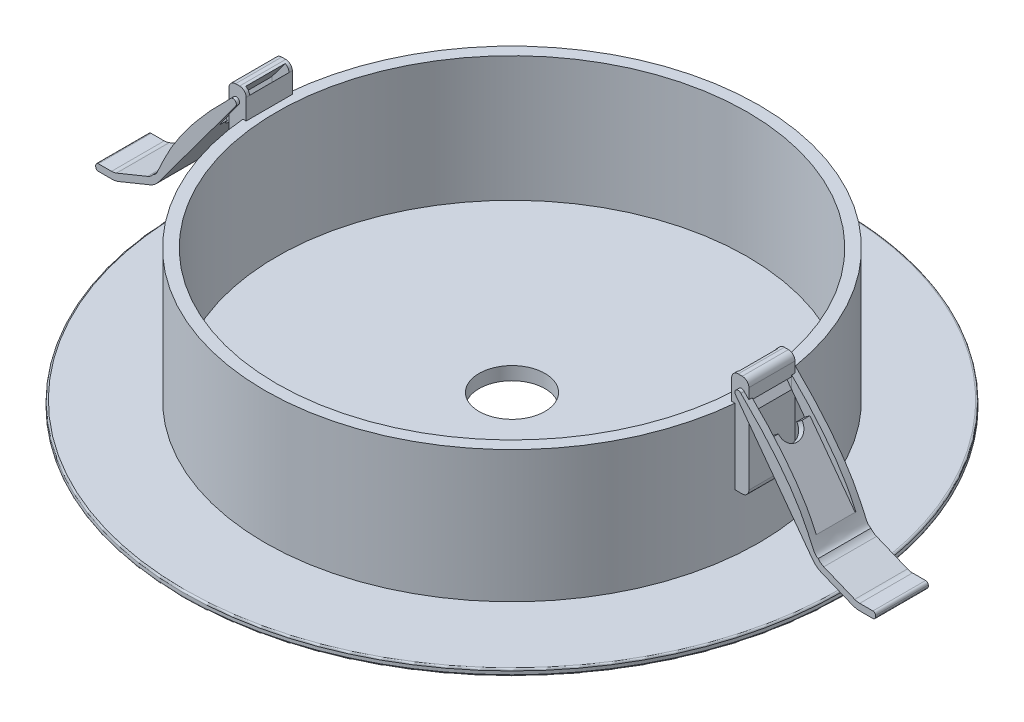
ISO-10303-21;
HEADER;
FILE_DESCRIPTION(('STEP AP214'),'2;1');
FILE_NAME('part.step','',(''),(''),'','','');
FILE_SCHEMA(('AUTOMOTIVE_DESIGN { 1 0 10303 214 1 1 1 1 }'));
ENDSEC;
DATA;
#1=APPLICATION_CONTEXT('core data for automotive mechanical design processes');
#2=APPLICATION_PROTOCOL_DEFINITION('international standard','automotive_design',2000,#1);
#3=PRODUCT_CONTEXT('',#1,'mechanical');
#4=PRODUCT('Part','Part','',(#3));
#5=PRODUCT_RELATED_PRODUCT_CATEGORY('part','',(#4));
#6=PRODUCT_DEFINITION_FORMATION('','',#4);
#7=PRODUCT_DEFINITION_CONTEXT('part definition',#1,'design');
#8=PRODUCT_DEFINITION('design','',#6,#7);
#9=PRODUCT_DEFINITION_SHAPE('','',#8);
#10=(LENGTH_UNIT() NAMED_UNIT(*) SI_UNIT(.MILLI.,.METRE.));
#11=(NAMED_UNIT(*) PLANE_ANGLE_UNIT() SI_UNIT($,.RADIAN.));
#12=(NAMED_UNIT(*) SI_UNIT($,.STERADIAN.) SOLID_ANGLE_UNIT());
#13=UNCERTAINTY_MEASURE_WITH_UNIT(LENGTH_MEASURE(1.E-05),#10,'distance_accuracy_value','');
#14=(GEOMETRIC_REPRESENTATION_CONTEXT(3) GLOBAL_UNCERTAINTY_ASSIGNED_CONTEXT((#13)) GLOBAL_UNIT_ASSIGNED_CONTEXT((#10,
#11,#12)) REPRESENTATION_CONTEXT('',''));
#15=CARTESIAN_POINT('',(0.,0.,0.));
#16=DIRECTION('',(0.,0.,1.));
#17=DIRECTION('',(1.,0.,0.));
#18=AXIS2_PLACEMENT_3D('',#15,#16,#17);
#19=CARTESIAN_POINT('',(38.3264994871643,22.9468725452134,4.));
#20=DIRECTION('',(0.,0.,-1.));
#21=DIRECTION('',(1.,0.,0.));
#22=AXIS2_PLACEMENT_3D('',#19,#20,#21);
#23=CYLINDRICAL_SURFACE('',#22,0.500000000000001);
#24=DIRECTION('',(0.,0.,-1.));
#25=VECTOR('',#24,1.);
#26=CARTESIAN_POINT('',(38.7283135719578,23.2444384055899,4.));
#27=LINE('',#26,#25);
#28=CARTESIAN_POINT('',(38.7283135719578,23.2444384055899,-3.));
#29=VERTEX_POINT('',#28);
#30=CARTESIAN_POINT('',(38.7283135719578,23.2444384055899,-4.));
#31=VERTEX_POINT('',#30);
#32=EDGE_CURVE('E65',#29,#31,#27,.T.);
#33=ORIENTED_EDGE('',*,*,#32,.T.);
#34=CARTESIAN_POINT('',(38.3264994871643,22.9468725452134,-4.));
#35=DIRECTION('',(0.,0.,-1.));
#36=DIRECTION('',(-1.,0.,0.));
#37=AXIS2_PLACEMENT_3D('',#34,#35,#36);
#38=CIRCLE('',#37,0.500000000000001);
#39=CARTESIAN_POINT('',(37.9246854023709,22.6493066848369,-4.));
#40=VERTEX_POINT('',#39);
#41=EDGE_CURVE('E210',#40,#31,#38,.T.);
#42=ORIENTED_EDGE('',*,*,#41,.F.);
#43=DIRECTION('',(0.,0.,-1.));
#44=VECTOR('',#43,1.);
#45=CARTESIAN_POINT('',(37.9246854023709,22.6493066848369,4.));
#46=LINE('',#45,#44);
#47=CARTESIAN_POINT('',(37.9246854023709,22.649306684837,-3.));
#48=VERTEX_POINT('',#47);
#49=EDGE_CURVE('E209',#48,#40,#46,.T.);
#50=ORIENTED_EDGE('',*,*,#49,.F.);
#51=CARTESIAN_POINT('',(38.3264994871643,22.9468725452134,-3.));
#52=DIRECTION('',(0.,0.,1.));
#53=DIRECTION('',(1.,0.,0.));
#54=AXIS2_PLACEMENT_3D('',#51,#52,#53);
#55=CIRCLE('',#54,0.500000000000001);
#56=EDGE_CURVE('E321',#29,#48,#55,.T.);
#57=ORIENTED_EDGE('',*,*,#56,.F.);
#58=EDGE_LOOP('',(#33,#42,#50,#57));
#59=FACE_BOUND('',#58,.T.);
#60=ADVANCED_FACE('F56',(#59),#23,.T.);
#61=CARTESIAN_POINT('',(38.7283135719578,23.2444384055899,4.));
#62=CARTESIAN_POINT('',(49.6913148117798,12.5997411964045,4.));
#63=CARTESIAN_POINT('',(48.9482320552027,7.96692643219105,4.));
#64=CARTESIAN_POINT('',(50.461584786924,7.40057234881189,4.));
#65=B_SPLINE_CURVE_WITH_KNOTS('',3,(#61,#62,#63,#64),.UNSPECIFIED.,.F.,.F.,(4,4),(0.,1.),.UNSPECIFIED.);
#66=DIRECTION('',(0.,0.,-1.));
#67=VECTOR('',#66,1.);
#68=SURFACE_OF_LINEAR_EXTRUSION('',#65,#67);
#69=CARTESIAN_POINT('',(38.7283135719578,23.2444384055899,-3.));
#70=CARTESIAN_POINT('',(39.0727910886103,22.909934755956,-3.));
#71=CARTESIAN_POINT('',(39.414663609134,22.5727271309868,-3.));
#72=CARTESIAN_POINT('',(40.0941006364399,21.8908662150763,-3.));
#73=CARTESIAN_POINT('',(40.4316376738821,21.546185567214,-3.));
#74=CARTESIAN_POINT('',(41.1011395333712,20.8493497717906,-3.));
#75=CARTESIAN_POINT('',(41.4330834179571,20.4971744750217,-3.));
#76=CARTESIAN_POINT('',(42.0900285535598,19.7852336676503,-3.));
#77=CARTESIAN_POINT('',(42.4150163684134,19.4254557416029,-3.));
#78=CARTESIAN_POINT('',(43.0565899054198,18.6981050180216,-3.));
#79=CARTESIAN_POINT('',(43.3731707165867,18.3305278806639,-3.));
#80=CARTESIAN_POINT('',(43.9900874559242,17.5947176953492,-3.));
#81=CARTESIAN_POINT('',(44.2906233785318,17.2266526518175,-3.));
#82=CARTESIAN_POINT('',(44.8805271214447,16.4822076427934,-3.));
#83=CARTESIAN_POINT('',(45.1699049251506,16.1058356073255,-3.));
#84=CARTESIAN_POINT('',(45.7356684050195,15.3441464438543,-3.));
#85=CARTESIAN_POINT('',(46.0120697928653,14.9588410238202,-3.));
#86=CARTESIAN_POINT('',(46.549811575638,14.1784925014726,-3.));
#87=CARTESIAN_POINT('',(46.8111690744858,13.7834612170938,-3.));
#88=CARTESIAN_POINT('',(47.3165160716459,12.9826476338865,-3.));
#89=CARTESIAN_POINT('',(47.5605144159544,12.5768709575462,-3.));
#90=CARTESIAN_POINT('',(47.8793429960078,12.016418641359,-3.));
#91=CARTESIAN_POINT('',(47.9628269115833,11.8666298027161,-3.));
#92=CARTESIAN_POINT('',(48.1271033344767,11.5655496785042,-3.));
#93=CARTESIAN_POINT('',(48.2078954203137,11.4142581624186,-3.));
#94=CARTESIAN_POINT('',(48.3667172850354,11.110212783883,-3.));
#95=CARTESIAN_POINT('',(48.4447467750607,10.9574587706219,-3.));
#96=CARTESIAN_POINT('',(48.5983796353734,10.6499175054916,-3.));
#97=CARTESIAN_POINT('',(48.673971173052,10.4951243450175,-3.));
#98=CARTESIAN_POINT('',(48.8225323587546,10.1842975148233,-3.));
#99=CARTESIAN_POINT('',(48.8955021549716,10.0282639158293,-3.));
#100=CARTESIAN_POINT('',(49.0033381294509,9.79349333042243,-3.));
#101=CARTESIAN_POINT('',(49.0390101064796,9.71512447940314,-3.));
#102=CARTESIAN_POINT('',(49.1099409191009,9.55820168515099,-3.));
#103=CARTESIAN_POINT('',(49.1451997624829,9.47964774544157,-3.));
#104=CARTESIAN_POINT('',(49.1803145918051,9.40102987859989,-3.));
#105=B_SPLINE_CURVE_WITH_KNOTS('',3,(#69,#70,#71,#72,#73,#74,#75,#76,#77,#78,#79,#80,#81,#82,
#83,#84,#85,#86,#87,#88,#89,#90,#91,#92,#93,#94,#95,#96,#97,#98,#99,#100,#101,#102,#103,#104),
.UNSPECIFIED.,.F.,.F.,(4,2,2,2,2,2,2,2,2,2,2,2,2,2,2,2,2,4),(0.,1.44049932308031,
2.88770561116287,4.33947732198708,5.79383792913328,7.24903020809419,8.67438327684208,
10.0984299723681,11.5207054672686,12.9413306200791,14.3612265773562,14.8756534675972,
15.390160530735,15.9047212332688,16.4214874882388,16.9382244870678,17.1965402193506,
17.4548510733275),.UNSPECIFIED.);
#106=CARTESIAN_POINT('',(49.1803145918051,9.40102987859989,-3.));
#107=VERTEX_POINT('',#106);
#108=EDGE_CURVE('E327',#29,#107,#105,.T.);
#109=ORIENTED_EDGE('',*,*,#108,.T.);
#110=DIRECTION('',(0.,0.,-1.));
#111=VECTOR('',#110,1.);
#112=CARTESIAN_POINT('',(49.1803145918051,9.40102987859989,3.));
#113=LINE('',#112,#111);
#114=CARTESIAN_POINT('',(49.1803145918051,9.40102987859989,3.));
#115=VERTEX_POINT('',#114);
#116=EDGE_CURVE('E365',#115,#107,#113,.T.);
#117=ORIENTED_EDGE('',*,*,#116,.F.);
#118=CARTESIAN_POINT('',(38.7283135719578,23.2444384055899,3.));
#119=CARTESIAN_POINT('',(39.0727910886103,22.909934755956,3.));
#120=CARTESIAN_POINT('',(39.414663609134,22.5727271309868,3.));
#121=CARTESIAN_POINT('',(40.0941006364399,21.8908662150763,3.));
#122=CARTESIAN_POINT('',(40.4316376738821,21.546185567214,3.));
#123=CARTESIAN_POINT('',(41.1011395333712,20.8493497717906,3.));
#124=CARTESIAN_POINT('',(41.4330834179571,20.4971744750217,3.));
#125=CARTESIAN_POINT('',(42.0900285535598,19.7852336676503,3.));
#126=CARTESIAN_POINT('',(42.4150163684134,19.4254557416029,3.));
#127=CARTESIAN_POINT('',(43.0565899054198,18.6981050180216,3.));
#128=CARTESIAN_POINT('',(43.3731707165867,18.3305278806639,3.));
#129=CARTESIAN_POINT('',(43.9900874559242,17.5947176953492,3.));
#130=CARTESIAN_POINT('',(44.2906233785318,17.2266526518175,3.));
#131=CARTESIAN_POINT('',(44.8805271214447,16.4822076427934,3.));
#132=CARTESIAN_POINT('',(45.1699049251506,16.1058356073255,3.));
#133=CARTESIAN_POINT('',(45.7356684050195,15.3441464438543,3.));
#134=CARTESIAN_POINT('',(46.0120697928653,14.9588410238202,3.));
#135=CARTESIAN_POINT('',(46.549811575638,14.1784925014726,3.));
#136=CARTESIAN_POINT('',(46.8111690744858,13.7834612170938,3.));
#137=CARTESIAN_POINT('',(47.3165160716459,12.9826476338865,3.));
#138=CARTESIAN_POINT('',(47.5605144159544,12.5768709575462,3.));
#139=CARTESIAN_POINT('',(47.8793429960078,12.016418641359,3.));
#140=CARTESIAN_POINT('',(47.9628269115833,11.8666298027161,3.));
#141=CARTESIAN_POINT('',(48.1271033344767,11.5655496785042,3.));
#142=CARTESIAN_POINT('',(48.2078954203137,11.4142581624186,3.));
#143=CARTESIAN_POINT('',(48.3667172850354,11.110212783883,3.));
#144=CARTESIAN_POINT('',(48.4447467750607,10.9574587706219,3.));
#145=CARTESIAN_POINT('',(48.5983796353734,10.6499175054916,3.));
#146=CARTESIAN_POINT('',(48.673971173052,10.4951243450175,3.));
#147=CARTESIAN_POINT('',(48.8225323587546,10.1842975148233,3.));
#148=CARTESIAN_POINT('',(48.8955021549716,10.0282639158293,3.));
#149=CARTESIAN_POINT('',(49.0033381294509,9.79349333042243,3.));
#150=CARTESIAN_POINT('',(49.0390101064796,9.71512447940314,3.));
#151=CARTESIAN_POINT('',(49.1099409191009,9.55820168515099,3.));
#152=CARTESIAN_POINT('',(49.1451997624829,9.47964774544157,3.));
#153=CARTESIAN_POINT('',(49.1803145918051,9.40102987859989,3.));
#154=B_SPLINE_CURVE_WITH_KNOTS('',3,(#118,#119,#120,#121,#122,#123,#124,#125,#126,#127,#128,
#129,#130,#131,#132,#133,#134,#135,#136,#137,#138,#139,#140,#141,#142,#143,#144,#145,#146,#147,
#148,#149,#150,#151,#152,#153),.UNSPECIFIED.,.F.,.F.,(4,2,2,2,2,2,2,2,2,2,2,2,2,2,2,2,2,4),(0.,
1.44049932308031,2.88770561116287,4.33947732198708,5.79383792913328,7.24903020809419,
8.67438327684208,10.0984299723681,11.5207054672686,12.9413306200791,14.3612265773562,
14.8756534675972,15.390160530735,15.9047212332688,16.4214874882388,16.9382244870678,
17.1965402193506,17.4548510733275),.UNSPECIFIED.);
#155=CARTESIAN_POINT('',(38.7283135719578,23.2444384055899,3.));
#156=VERTEX_POINT('',#155);
#157=EDGE_CURVE('E355',#156,#115,#154,.T.);
#158=ORIENTED_EDGE('',*,*,#157,.F.);
#159=CARTESIAN_POINT('',(38.7283135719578,23.2444384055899,4.));
#160=VERTEX_POINT('',#159);
#161=EDGE_CURVE('E12',#160,#156,#27,.T.);
#162=ORIENTED_EDGE('',*,*,#161,.F.);
#163=CARTESIAN_POINT('',(50.461584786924,7.40057234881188,4.));
#164=VERTEX_POINT('',#163);
#165=EDGE_CURVE('E462',#160,#164,#65,.T.);
#166=ORIENTED_EDGE('',*,*,#165,.T.);
#167=DIRECTION('',(0.,0.,-1.));
#168=VECTOR('',#167,1.);
#169=CARTESIAN_POINT('',(50.461584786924,7.40057234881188,4.));
#170=LINE('',#169,#168);
#171=CARTESIAN_POINT('',(50.461584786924,7.40057234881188,-4.));
#172=VERTEX_POINT('',#171);
#173=EDGE_CURVE('E304',#164,#172,#170,.T.);
#174=ORIENTED_EDGE('',*,*,#173,.T.);
#175=CARTESIAN_POINT('',(38.7283135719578,23.2444384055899,-4.));
#176=CARTESIAN_POINT('',(49.6913148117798,12.5997411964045,-4.));
#177=CARTESIAN_POINT('',(48.9482320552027,7.96692643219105,-4.));
#178=CARTESIAN_POINT('',(50.461584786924,7.40057234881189,-4.));
#179=B_SPLINE_CURVE_WITH_KNOTS('',3,(#175,#176,#177,#178),.UNSPECIFIED.,.F.,.F.,(4,4),(0.,1.),.UNSPECIFIED.);
#180=EDGE_CURVE('E213',#31,#172,#179,.T.);
#181=ORIENTED_EDGE('',*,*,#180,.F.);
#182=ORIENTED_EDGE('',*,*,#32,.F.);
#183=EDGE_LOOP('',(#109,#117,#158,#162,#166,#174,#181,#182));
#184=FACE_BOUND('',#183,.T.);
#185=ADVANCED_FACE('F323',(#184),#68,.T.);
#186=CARTESIAN_POINT('',(37.9246854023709,22.6493066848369,4.));
#187=VERTEX_POINT('',#186);
#188=CARTESIAN_POINT('',(37.9246854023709,22.649306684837,2.9851983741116));
#189=VERTEX_POINT('',#188);
#190=EDGE_CURVE('E266',#187,#189,#46,.T.);
#191=ORIENTED_EDGE('',*,*,#190,.F.);
#192=CARTESIAN_POINT('',(38.3264994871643,22.9468725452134,4.));
#193=DIRECTION('',(0.,0.,-1.));
#194=DIRECTION('',(-1.,0.,0.));
#195=AXIS2_PLACEMENT_3D('',#192,#193,#194);
#196=CIRCLE('',#195,0.500000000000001);
#197=EDGE_CURVE('E139',#187,#160,#196,.T.);
#198=ORIENTED_EDGE('',*,*,#197,.T.);
#199=ORIENTED_EDGE('',*,*,#161,.T.);
#200=DIRECTION('',(0.,0.,-1.));
#201=VECTOR('',#200,1.);
#202=CARTESIAN_POINT('',(38.7283135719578,23.2444384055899,3.));
#203=LINE('',#202,#201);
#204=CARTESIAN_POINT('',(38.7283135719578,23.2444384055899,2.9851983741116));
#205=VERTEX_POINT('',#204);
#206=EDGE_CURVE('E362',#156,#205,#203,.T.);
#207=ORIENTED_EDGE('',*,*,#206,.T.);
#208=CARTESIAN_POINT('',(38.3264994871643,22.9468725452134,2.9851983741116));
#209=DIRECTION('',(0.,0.,-1.));
#210=DIRECTION('',(0.,-1.,0.));
#211=AXIS2_PLACEMENT_3D('',#208,#209,#210);
#212=CIRCLE('',#211,0.500000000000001);
#213=EDGE_CURVE('E516',#189,#205,#212,.T.);
#214=ORIENTED_EDGE('',*,*,#213,.F.);
#215=EDGE_LOOP('',(#191,#198,#199,#207,#214));
#216=FACE_BOUND('',#215,.T.);
#217=ADVANCED_FACE('F58',(#216),#23,.T.);
#218=CARTESIAN_POINT('',(52.0688411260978,8.59083579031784,4.));
#219=DIRECTION('',(0.,0.,-1.));
#220=DIRECTION('',(1.,0.,0.));
#221=AXIS2_PLACEMENT_3D('',#218,#219,#220);
#222=CYLINDRICAL_SURFACE('',#221,2.);
#223=CARTESIAN_POINT('',(52.0688411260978,8.59083579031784,-4.));
#224=DIRECTION('',(0.,0.,1.));
#225=DIRECTION('',(1.,0.,0.));
#226=AXIS2_PLACEMENT_3D('',#223,#224,#225);
#227=CIRCLE('',#226,2.);
#228=CARTESIAN_POINT('',(51.3119296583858,6.73959700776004,-4.));
#229=VERTEX_POINT('',#228);
#230=EDGE_CURVE('E220',#172,#229,#227,.T.);
#231=ORIENTED_EDGE('',*,*,#230,.F.);
#232=ORIENTED_EDGE('',*,*,#173,.F.);
#233=CARTESIAN_POINT('',(52.0688411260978,8.59083579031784,4.));
#234=DIRECTION('',(0.,0.,1.));
#235=DIRECTION('',(1.,0.,0.));
#236=AXIS2_PLACEMENT_3D('',#233,#234,#235);
#237=CIRCLE('',#236,2.);
#238=CARTESIAN_POINT('',(51.3119296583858,6.73959700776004,4.));
#239=VERTEX_POINT('',#238);
#240=EDGE_CURVE('E468',#164,#239,#237,.T.);
#241=ORIENTED_EDGE('',*,*,#240,.T.);
#242=DIRECTION('',(0.,0.,-1.));
#243=VECTOR('',#242,1.);
#244=CARTESIAN_POINT('',(51.3119296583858,6.73959700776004,4.));
#245=LINE('',#244,#243);
#246=EDGE_CURVE('E301',#239,#229,#245,.T.);
#247=ORIENTED_EDGE('',*,*,#246,.T.);
#248=EDGE_LOOP('',(#231,#232,#241,#247));
#249=FACE_BOUND('',#248,.T.);
#250=ADVANCED_FACE('F456',(#249),#222,.F.);
#251=CARTESIAN_POINT('',(51.3119296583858,6.73959700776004,4.));
#252=DIRECTION('',(-0.37845573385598,-0.925619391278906,0.));
#253=DIRECTION('',(-0.925619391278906,0.37845573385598,0.));
#254=AXIS2_PLACEMENT_3D('',#251,#252,#253);
#255=PLANE('',#254);
#256=DIRECTION('',(0.925619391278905,-0.37845573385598,0.));
#257=VECTOR('',#256,1.);
#258=CARTESIAN_POINT('',(51.3119296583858,6.73959700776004,-4.));
#259=LINE('',#258,#257);
#260=CARTESIAN_POINT('',(56.0144456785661,4.81689079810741,-4.));
#261=VERTEX_POINT('',#260);
#262=EDGE_CURVE('E227',#229,#261,#259,.T.);
#263=ORIENTED_EDGE('',*,*,#262,.F.);
#264=ORIENTED_EDGE('',*,*,#246,.F.);
#265=DIRECTION('',(0.925619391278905,-0.37845573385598,0.));
#266=VECTOR('',#265,1.);
#267=CARTESIAN_POINT('',(51.3119296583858,6.73959700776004,4.));
#268=LINE('',#267,#266);
#269=CARTESIAN_POINT('',(56.0144456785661,4.81689079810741,4.));
#270=VERTEX_POINT('',#269);
#271=EDGE_CURVE('E475',#239,#270,#268,.T.);
#272=ORIENTED_EDGE('',*,*,#271,.T.);
#273=DIRECTION('',(0.,0.,-1.));
#274=VECTOR('',#273,1.);
#275=CARTESIAN_POINT('',(56.0144456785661,4.81689079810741,4.));
#276=LINE('',#275,#274);
#277=EDGE_CURVE('E297',#270,#261,#276,.T.);
#278=ORIENTED_EDGE('',*,*,#277,.T.);
#279=EDGE_LOOP('',(#263,#264,#272,#278));
#280=FACE_BOUND('',#279,.T.);
#281=ADVANCED_FACE('F452',(#280),#255,.F.);
#282=CARTESIAN_POINT('',(56.7713571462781,6.66812958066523,4.));
#283=DIRECTION('',(0.,0.,-1.));
#284=DIRECTION('',(1.,0.,0.));
#285=AXIS2_PLACEMENT_3D('',#282,#283,#284);
#286=CYLINDRICAL_SURFACE('',#285,2.);
#287=CARTESIAN_POINT('',(56.7713571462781,6.66812958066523,-4.));
#288=DIRECTION('',(0.,0.,1.));
#289=DIRECTION('',(1.,0.,0.));
#290=AXIS2_PLACEMENT_3D('',#287,#288,#289);
#291=CIRCLE('',#290,2.);
#292=CARTESIAN_POINT('',(56.7713571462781,4.66812958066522,-4.));
#293=VERTEX_POINT('',#292);
#294=EDGE_CURVE('E231',#261,#293,#291,.T.);
#295=ORIENTED_EDGE('',*,*,#294,.F.);
#296=ORIENTED_EDGE('',*,*,#277,.F.);
#297=CARTESIAN_POINT('',(56.7713571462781,6.66812958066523,4.));
#298=DIRECTION('',(0.,0.,1.));
#299=DIRECTION('',(1.,0.,0.));
#300=AXIS2_PLACEMENT_3D('',#297,#298,#299);
#301=CIRCLE('',#300,2.);
#302=CARTESIAN_POINT('',(56.7713571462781,4.66812958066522,4.));
#303=VERTEX_POINT('',#302);
#304=EDGE_CURVE('E479',#270,#303,#301,.T.);
#305=ORIENTED_EDGE('',*,*,#304,.T.);
#306=DIRECTION('',(0.,0.,-1.));
#307=VECTOR('',#306,1.);
#308=CARTESIAN_POINT('',(56.7713571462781,4.66812958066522,4.));
#309=LINE('',#308,#307);
#310=EDGE_CURVE('E293',#303,#293,#309,.T.);
#311=ORIENTED_EDGE('',*,*,#310,.T.);
#312=EDGE_LOOP('',(#295,#296,#305,#311));
#313=FACE_BOUND('',#312,.T.);
#314=ADVANCED_FACE('F448',(#313),#286,.F.);
#315=CARTESIAN_POINT('',(56.7713571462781,4.66812958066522,4.));
#316=DIRECTION('',(0.,-1.,0.));
#317=DIRECTION('',(-1.,0.,0.));
#318=AXIS2_PLACEMENT_3D('',#315,#316,#317);
#319=PLANE('',#318);
#320=DIRECTION('',(1.,0.,0.));
#321=VECTOR('',#320,1.);
#322=CARTESIAN_POINT('',(56.7713571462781,4.66812958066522,-4.));
#323=LINE('',#322,#321);
#324=CARTESIAN_POINT('',(58.764101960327,4.66812958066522,-4.));
#325=VERTEX_POINT('',#324);
#326=EDGE_CURVE('E235',#293,#325,#323,.T.);
#327=ORIENTED_EDGE('',*,*,#326,.F.);
#328=ORIENTED_EDGE('',*,*,#310,.F.);
#329=DIRECTION('',(1.,0.,0.));
#330=VECTOR('',#329,1.);
#331=CARTESIAN_POINT('',(56.7713571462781,4.66812958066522,4.));
#332=LINE('',#331,#330);
#333=CARTESIAN_POINT('',(58.764101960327,4.66812958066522,4.));
#334=VERTEX_POINT('',#333);
#335=EDGE_CURVE('E483',#303,#334,#332,.T.);
#336=ORIENTED_EDGE('',*,*,#335,.T.);
#337=DIRECTION('',(0.,0.,-1.));
#338=VECTOR('',#337,1.);
#339=CARTESIAN_POINT('',(58.764101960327,4.66812958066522,4.));
#340=LINE('',#339,#338);
#341=EDGE_CURVE('E289',#334,#325,#340,.T.);
#342=ORIENTED_EDGE('',*,*,#341,.T.);
#343=EDGE_LOOP('',(#327,#328,#336,#342));
#344=FACE_BOUND('',#343,.T.);
#345=ADVANCED_FACE('F444',(#344),#319,.F.);
#346=CARTESIAN_POINT('',(58.764101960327,4.26812958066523,4.));
#347=DIRECTION('',(0.,0.,-1.));
#348=DIRECTION('',(1.,0.,0.));
#349=AXIS2_PLACEMENT_3D('',#346,#347,#348);
#350=CYLINDRICAL_SURFACE('',#349,0.399999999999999);
#351=CARTESIAN_POINT('',(58.764101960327,4.26812958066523,-4.));
#352=DIRECTION('',(0.,0.,-1.));
#353=DIRECTION('',(-1.,0.,0.));
#354=AXIS2_PLACEMENT_3D('',#351,#352,#353);
#355=CIRCLE('',#354,0.399999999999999);
#356=CARTESIAN_POINT('',(59.164101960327,4.26812958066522,-4.));
#357=VERTEX_POINT('',#356);
#358=EDGE_CURVE('E239',#325,#357,#355,.T.);
#359=ORIENTED_EDGE('',*,*,#358,.F.);
#360=ORIENTED_EDGE('',*,*,#341,.F.);
#361=CARTESIAN_POINT('',(58.764101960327,4.26812958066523,4.));
#362=DIRECTION('',(0.,0.,-1.));
#363=DIRECTION('',(-1.,0.,0.));
#364=AXIS2_PLACEMENT_3D('',#361,#362,#363);
#365=CIRCLE('',#364,0.399999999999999);
#366=CARTESIAN_POINT('',(59.164101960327,4.26812958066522,4.));
#367=VERTEX_POINT('',#366);
#368=EDGE_CURVE('E487',#334,#367,#365,.T.);
#369=ORIENTED_EDGE('',*,*,#368,.T.);
#370=DIRECTION('',(0.,0.,-1.));
#371=VECTOR('',#370,1.);
#372=CARTESIAN_POINT('',(59.164101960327,4.26812958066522,4.));
#373=LINE('',#372,#371);
#374=EDGE_CURVE('E285',#367,#357,#373,.T.);
#375=ORIENTED_EDGE('',*,*,#374,.T.);
#376=EDGE_LOOP('',(#359,#360,#369,#375));
#377=FACE_BOUND('',#376,.T.);
#378=ADVANCED_FACE('F440',(#377),#350,.T.);
#379=CARTESIAN_POINT('',(59.164101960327,4.26812958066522,4.));
#380=DIRECTION('',(-1.,0.,0.));
#381=DIRECTION('',(0.,0.,-1.));
#382=AXIS2_PLACEMENT_3D('',#379,#380,#381);
#383=PLANE('',#382);
#384=DIRECTION('',(0.,-1.,0.));
#385=VECTOR('',#384,1.);
#386=CARTESIAN_POINT('',(59.164101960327,4.26812958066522,-4.));
#387=LINE('',#386,#385);
#388=CARTESIAN_POINT('',(59.164101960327,4.06812958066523,-4.));
#389=VERTEX_POINT('',#388);
#390=EDGE_CURVE('E243',#357,#389,#387,.T.);
#391=ORIENTED_EDGE('',*,*,#390,.F.);
#392=ORIENTED_EDGE('',*,*,#374,.F.);
#393=DIRECTION('',(0.,-1.,0.));
#394=VECTOR('',#393,1.);
#395=CARTESIAN_POINT('',(59.164101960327,4.26812958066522,4.));
#396=LINE('',#395,#394);
#397=CARTESIAN_POINT('',(59.164101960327,4.06812958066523,4.));
#398=VERTEX_POINT('',#397);
#399=EDGE_CURVE('E491',#367,#398,#396,.T.);
#400=ORIENTED_EDGE('',*,*,#399,.T.);
#401=DIRECTION('',(0.,0.,-1.));
#402=VECTOR('',#401,1.);
#403=CARTESIAN_POINT('',(59.164101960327,4.06812958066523,4.));
#404=LINE('',#403,#402);
#405=EDGE_CURVE('E281',#398,#389,#404,.T.);
#406=ORIENTED_EDGE('',*,*,#405,.T.);
#407=EDGE_LOOP('',(#391,#392,#400,#406));
#408=FACE_BOUND('',#407,.T.);
#409=ADVANCED_FACE('F436',(#408),#383,.F.);
#410=CARTESIAN_POINT('',(58.764101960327,4.06812958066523,4.));
#411=DIRECTION('',(0.,0.,-1.));
#412=DIRECTION('',(1.,0.,0.));
#413=AXIS2_PLACEMENT_3D('',#410,#411,#412);
#414=CYLINDRICAL_SURFACE('',#413,0.399999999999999);
#415=CARTESIAN_POINT('',(58.764101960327,4.06812958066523,-4.));
#416=DIRECTION('',(0.,0.,-1.));
#417=DIRECTION('',(1.,0.,0.));
#418=AXIS2_PLACEMENT_3D('',#415,#416,#417);
#419=CIRCLE('',#418,0.399999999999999);
#420=CARTESIAN_POINT('',(58.764101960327,3.66812958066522,-4.));
#421=VERTEX_POINT('',#420);
#422=EDGE_CURVE('E247',#389,#421,#419,.T.);
#423=ORIENTED_EDGE('',*,*,#422,.F.);
#424=ORIENTED_EDGE('',*,*,#405,.F.);
#425=CARTESIAN_POINT('',(58.764101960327,4.06812958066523,4.));
#426=DIRECTION('',(0.,0.,-1.));
#427=DIRECTION('',(1.,0.,0.));
#428=AXIS2_PLACEMENT_3D('',#425,#426,#427);
#429=CIRCLE('',#428,0.399999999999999);
#430=CARTESIAN_POINT('',(58.764101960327,3.66812958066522,4.));
#431=VERTEX_POINT('',#430);
#432=EDGE_CURVE('E495',#398,#431,#429,.T.);
#433=ORIENTED_EDGE('',*,*,#432,.T.);
#434=DIRECTION('',(0.,0.,-1.));
#435=VECTOR('',#434,1.);
#436=CARTESIAN_POINT('',(58.764101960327,3.66812958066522,4.));
#437=LINE('',#436,#435);
#438=EDGE_CURVE('E277',#431,#421,#437,.T.);
#439=ORIENTED_EDGE('',*,*,#438,.T.);
#440=EDGE_LOOP('',(#423,#424,#433,#439));
#441=FACE_BOUND('',#440,.T.);
#442=ADVANCED_FACE('F432',(#441),#414,.T.);
#443=CARTESIAN_POINT('',(56.7713571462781,3.66812958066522,4.));
#444=DIRECTION('',(0.,1.,0.));
#445=DIRECTION('',(1.,0.,0.));
#446=AXIS2_PLACEMENT_3D('',#443,#444,#445);
#447=PLANE('',#446);
#448=DIRECTION('',(-1.,0.,0.));
#449=VECTOR('',#448,1.);
#450=CARTESIAN_POINT('',(56.7713571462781,3.66812958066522,-4.));
#451=LINE('',#450,#449);
#452=CARTESIAN_POINT('',(56.7713571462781,3.66812958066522,-4.));
#453=VERTEX_POINT('',#452);
#454=EDGE_CURVE('E251',#421,#453,#451,.T.);
#455=ORIENTED_EDGE('',*,*,#454,.F.);
#456=ORIENTED_EDGE('',*,*,#438,.F.);
#457=DIRECTION('',(-1.,0.,0.));
#458=VECTOR('',#457,1.);
#459=CARTESIAN_POINT('',(56.7713571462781,3.66812958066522,4.));
#460=LINE('',#459,#458);
#461=CARTESIAN_POINT('',(56.7713571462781,3.66812958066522,4.));
#462=VERTEX_POINT('',#461);
#463=EDGE_CURVE('E203',#431,#462,#460,.T.);
#464=ORIENTED_EDGE('',*,*,#463,.T.);
#465=DIRECTION('',(0.,0.,-1.));
#466=VECTOR('',#465,1.);
#467=CARTESIAN_POINT('',(56.7713571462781,3.66812958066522,4.));
#468=LINE('',#467,#466);
#469=EDGE_CURVE('E273',#462,#453,#468,.T.);
#470=ORIENTED_EDGE('',*,*,#469,.T.);
#471=EDGE_LOOP('',(#455,#456,#464,#470));
#472=FACE_BOUND('',#471,.T.);
#473=ADVANCED_FACE('F428',(#472),#447,.F.);
#474=CARTESIAN_POINT('',(56.7713571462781,6.66812958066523,4.));
#475=DIRECTION('',(0.,0.,-1.));
#476=DIRECTION('',(1.,0.,0.));
#477=AXIS2_PLACEMENT_3D('',#474,#475,#476);
#478=CYLINDRICAL_SURFACE('',#477,3.);
#479=CARTESIAN_POINT('',(56.7713571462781,6.66812958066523,-4.));
#480=DIRECTION('',(0.,0.,-1.));
#481=DIRECTION('',(1.,0.,0.));
#482=AXIS2_PLACEMENT_3D('',#479,#480,#481);
#483=CIRCLE('',#482,3.);
#484=CARTESIAN_POINT('',(55.6359899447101,3.89127140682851,-4.));
#485=VERTEX_POINT('',#484);
#486=EDGE_CURVE('E255',#453,#485,#483,.T.);
#487=ORIENTED_EDGE('',*,*,#486,.F.);
#488=ORIENTED_EDGE('',*,*,#469,.F.);
#489=CARTESIAN_POINT('',(56.7713571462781,6.66812958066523,4.));
#490=DIRECTION('',(0.,0.,-1.));
#491=DIRECTION('',(1.,0.,0.));
#492=AXIS2_PLACEMENT_3D('',#489,#490,#491);
#493=CIRCLE('',#492,3.);
#494=CARTESIAN_POINT('',(55.6359899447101,3.89127140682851,4.));
#495=VERTEX_POINT('',#494);
#496=EDGE_CURVE('E199',#462,#495,#493,.T.);
#497=ORIENTED_EDGE('',*,*,#496,.T.);
#498=DIRECTION('',(0.,0.,-1.));
#499=VECTOR('',#498,1.);
#500=CARTESIAN_POINT('',(55.6359899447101,3.89127140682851,4.));
#501=LINE('',#500,#499);
#502=EDGE_CURVE('E192',#495,#485,#501,.T.);
#503=ORIENTED_EDGE('',*,*,#502,.T.);
#504=EDGE_LOOP('',(#487,#488,#497,#503));
#505=FACE_BOUND('',#504,.T.);
#506=ADVANCED_FACE('F425',(#505),#478,.T.);
#507=CARTESIAN_POINT('',(50.9334739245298,5.81397761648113,4.));
#508=DIRECTION('',(0.37845573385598,0.925619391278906,0.));
#509=DIRECTION('',(0.925619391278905,-0.37845573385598,0.));
#510=AXIS2_PLACEMENT_3D('',#507,#508,#509);
#511=PLANE('',#510);
#512=DIRECTION('',(-0.925619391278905,0.37845573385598,0.));
#513=VECTOR('',#512,1.);
#514=CARTESIAN_POINT('',(50.9334739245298,5.81397761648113,-4.));
#515=LINE('',#514,#513);
#516=CARTESIAN_POINT('',(50.9334739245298,5.81397761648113,-4.));
#517=VERTEX_POINT('',#516);
#518=EDGE_CURVE('E259',#485,#517,#515,.T.);
#519=ORIENTED_EDGE('',*,*,#518,.F.);
#520=ORIENTED_EDGE('',*,*,#502,.F.);
#521=DIRECTION('',(-0.925619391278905,0.37845573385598,0.));
#522=VECTOR('',#521,1.);
#523=CARTESIAN_POINT('',(50.9334739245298,5.81397761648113,4.));
#524=LINE('',#523,#522);
#525=CARTESIAN_POINT('',(50.9334739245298,5.81397761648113,4.));
#526=VERTEX_POINT('',#525);
#527=EDGE_CURVE('E179',#495,#526,#524,.T.);
#528=ORIENTED_EDGE('',*,*,#527,.T.);
#529=DIRECTION('',(0.,0.,-1.));
#530=VECTOR('',#529,1.);
#531=CARTESIAN_POINT('',(50.9334739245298,5.81397761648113,4.));
#532=LINE('',#531,#530);
#533=EDGE_CURVE('E186',#526,#517,#532,.T.);
#534=ORIENTED_EDGE('',*,*,#533,.T.);
#535=EDGE_LOOP('',(#519,#520,#528,#534));
#536=FACE_BOUND('',#535,.T.);
#537=ADVANCED_FACE('F195',(#536),#511,.F.);
#538=CARTESIAN_POINT('',(52.0688411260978,8.59083579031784,4.));
#539=DIRECTION('',(0.,0.,-1.));
#540=DIRECTION('',(1.,0.,0.));
#541=AXIS2_PLACEMENT_3D('',#538,#539,#540);
#542=CYLINDRICAL_SURFACE('',#541,3.);
#543=CARTESIAN_POINT('',(52.0688411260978,8.59083579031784,-4.));
#544=DIRECTION('',(0.,0.,-1.));
#545=DIRECTION('',(1.,0.,0.));
#546=AXIS2_PLACEMENT_3D('',#543,#544,#545);
#547=CIRCLE('',#546,3.);
#548=CARTESIAN_POINT('',(49.6579566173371,6.80544062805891,-4.));
#549=VERTEX_POINT('',#548);
#550=EDGE_CURVE('E188',#517,#549,#547,.T.);
#551=ORIENTED_EDGE('',*,*,#550,.F.);
#552=ORIENTED_EDGE('',*,*,#533,.F.);
#553=CARTESIAN_POINT('',(52.0688411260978,8.59083579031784,4.));
#554=DIRECTION('',(0.,0.,-1.));
#555=DIRECTION('',(1.,0.,0.));
#556=AXIS2_PLACEMENT_3D('',#553,#554,#555);
#557=CIRCLE('',#556,3.);
#558=CARTESIAN_POINT('',(49.6579566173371,6.80544062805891,4.));
#559=VERTEX_POINT('',#558);
#560=EDGE_CURVE('E175',#526,#559,#557,.T.);
#561=ORIENTED_EDGE('',*,*,#560,.T.);
#562=DIRECTION('',(0.,0.,-1.));
#563=VECTOR('',#562,1.);
#564=CARTESIAN_POINT('',(49.6579566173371,6.80544062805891,4.));
#565=LINE('',#564,#563);
#566=EDGE_CURVE('E193',#559,#549,#565,.T.);
#567=ORIENTED_EDGE('',*,*,#566,.T.);
#568=EDGE_LOOP('',(#551,#552,#561,#567));
#569=FACE_BOUND('',#568,.T.);
#570=ADVANCED_FACE('F187',(#569),#542,.T.);
#571=CARTESIAN_POINT('',(37.9246854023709,22.6493066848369,4.));
#572=DIRECTION('',(0.803628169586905,0.595131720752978,0.));
#573=DIRECTION('',(0.595131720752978,-0.803628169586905,0.));
#574=AXIS2_PLACEMENT_3D('',#571,#572,#573);
#575=PLANE('',#574);
#576=ORIENTED_EDGE('',*,*,#49,.T.);
#577=DIRECTION('',(-0.595131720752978,0.803628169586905,0.));
#578=VECTOR('',#577,1.);
#579=CARTESIAN_POINT('',(37.9246854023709,22.6493066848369,-4.));
#580=LINE('',#579,#578);
#581=EDGE_CURVE('E132',#549,#40,#580,.T.);
#582=ORIENTED_EDGE('',*,*,#581,.F.);
#583=ORIENTED_EDGE('',*,*,#566,.F.);
#584=DIRECTION('',(-0.595131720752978,0.803628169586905,0.));
#585=VECTOR('',#584,1.);
#586=CARTESIAN_POINT('',(37.9246854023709,22.6493066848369,4.));
#587=LINE('',#586,#585);
#588=EDGE_CURVE('E81',#559,#187,#587,.T.);
#589=ORIENTED_EDGE('',*,*,#588,.T.);
#590=ORIENTED_EDGE('',*,*,#190,.T.);
#591=DIRECTION('',(-0.595131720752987,0.803628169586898,0.));
#592=VECTOR('',#591,1.);
#593=CARTESIAN_POINT('',(34.9387600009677,26.6813111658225,2.9851983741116));
#594=LINE('',#593,#592);
#595=CARTESIAN_POINT('',(41.4041923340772,17.9508009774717,2.9851983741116));
#596=VERTEX_POINT('',#595);
#597=EDGE_CURVE('E521',#596,#189,#594,.T.);
#598=ORIENTED_EDGE('',*,*,#597,.F.);
#599=DIRECTION('',(0.,0.,1.));
#600=VECTOR('',#599,1.);
#601=CARTESIAN_POINT('',(41.4041923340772,17.9508009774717,1.77998688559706));
#602=LINE('',#601,#600);
#603=CARTESIAN_POINT('',(41.4041923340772,17.9508009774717,1.77998688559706));
#604=VERTEX_POINT('',#603);
#605=EDGE_CURVE('E566',#604,#596,#602,.T.);
#606=ORIENTED_EDGE('',*,*,#605,.F.);
#607=CARTESIAN_POINT('',(41.4041923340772,17.9508009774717,-0.00740081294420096));
#608=DIRECTION('',(-0.803628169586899,-0.595131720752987,0.));
#609=DIRECTION('',(0.595131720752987,-0.803628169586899,0.));
#610=AXIS2_PLACEMENT_3D('',#607,#608,#609);
#611=CIRCLE('',#610,1.78738769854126);
#612=CARTESIAN_POINT('',(41.4041923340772,17.9508009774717,-1.79478851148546));
#613=VERTEX_POINT('',#612);
#614=EDGE_CURVE('E561',#613,#604,#611,.T.);
#615=ORIENTED_EDGE('',*,*,#614,.F.);
#616=DIRECTION('',(0.,0.,1.));
#617=VECTOR('',#616,1.);
#618=CARTESIAN_POINT('',(41.4041923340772,17.9508009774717,-3.));
#619=LINE('',#618,#617);
#620=CARTESIAN_POINT('',(41.4041923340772,17.9508009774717,-3.));
#621=VERTEX_POINT('',#620);
#622=EDGE_CURVE('E550',#621,#613,#619,.T.);
#623=ORIENTED_EDGE('',*,*,#622,.F.);
#624=DIRECTION('',(0.595131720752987,-0.803628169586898,0.));
#625=VECTOR('',#624,1.);
#626=CARTESIAN_POINT('',(34.9387600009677,26.6813111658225,-3.));
#627=LINE('',#626,#625);
#628=EDGE_CURVE('E556',#48,#621,#627,.T.);
#629=ORIENTED_EDGE('',*,*,#628,.F.);
#630=EDGE_LOOP('',(#576,#582,#583,#589,#590,#598,#606,#615,#623,#629));
#631=FACE_BOUND('',#630,.T.);
#632=ADVANCED_FACE('F416',(#631),#575,.F.);
#633=CARTESIAN_POINT('',(38.3264994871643,22.9468725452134,4.));
#634=DIRECTION('',(0.,0.,1.));
#635=DIRECTION('',(-1.,0.,0.));
#636=AXIS2_PLACEMENT_3D('',#633,#634,#635);
#637=PLANE('',#636);
#638=ORIENTED_EDGE('',*,*,#197,.F.);
#639=ORIENTED_EDGE('',*,*,#588,.F.);
#640=ORIENTED_EDGE('',*,*,#560,.F.);
#641=ORIENTED_EDGE('',*,*,#527,.F.);
#642=ORIENTED_EDGE('',*,*,#496,.F.);
#643=ORIENTED_EDGE('',*,*,#463,.F.);
#644=ORIENTED_EDGE('',*,*,#432,.F.);
#645=ORIENTED_EDGE('',*,*,#399,.F.);
#646=ORIENTED_EDGE('',*,*,#368,.F.);
#647=ORIENTED_EDGE('',*,*,#335,.F.);
#648=ORIENTED_EDGE('',*,*,#304,.F.);
#649=ORIENTED_EDGE('',*,*,#271,.F.);
#650=ORIENTED_EDGE('',*,*,#240,.F.);
#651=ORIENTED_EDGE('',*,*,#165,.F.);
#652=EDGE_LOOP('',(#638,#639,#640,#641,#642,#643,#644,#645,#646,#647,#648,#649,#650,#651));
#653=FACE_BOUND('',#652,.T.);
#654=ADVANCED_FACE('F177',(#653),#637,.T.);
#655=CARTESIAN_POINT('',(38.3264994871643,22.9468725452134,-4.));
#656=DIRECTION('',(0.,0.,1.));
#657=DIRECTION('',(-1.,0.,0.));
#658=AXIS2_PLACEMENT_3D('',#655,#656,#657);
#659=PLANE('',#658);
#660=ORIENTED_EDGE('',*,*,#41,.T.);
#661=ORIENTED_EDGE('',*,*,#180,.T.);
#662=ORIENTED_EDGE('',*,*,#230,.T.);
#663=ORIENTED_EDGE('',*,*,#262,.T.);
#664=ORIENTED_EDGE('',*,*,#294,.T.);
#665=ORIENTED_EDGE('',*,*,#326,.T.);
#666=ORIENTED_EDGE('',*,*,#358,.T.);
#667=ORIENTED_EDGE('',*,*,#390,.T.);
#668=ORIENTED_EDGE('',*,*,#422,.T.);
#669=ORIENTED_EDGE('',*,*,#454,.T.);
#670=ORIENTED_EDGE('',*,*,#486,.T.);
#671=ORIENTED_EDGE('',*,*,#518,.T.);
#672=ORIENTED_EDGE('',*,*,#550,.T.);
#673=ORIENTED_EDGE('',*,*,#581,.T.);
#674=EDGE_LOOP('',(#660,#661,#662,#663,#664,#665,#666,#667,#668,#669,#670,#671,#672,#673));
#675=FACE_BOUND('',#674,.T.);
#676=ADVANCED_FACE('F411',(#675),#659,.F.);
#677=CARTESIAN_POINT('',(52.0688411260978,8.59083579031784,4.));
#678=DIRECTION('',(0.,0.,-1.));
#679=DIRECTION('',(1.,0.,0.));
#680=AXIS2_PLACEMENT_3D('',#677,#678,#679);
#681=CYLINDRICAL_SURFACE('',#680,3.);
#682=CARTESIAN_POINT('',(52.0688411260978,8.59083579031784,-3.));
#683=DIRECTION('',(0.,0.,-1.));
#684=DIRECTION('',(-1.,0.,0.));
#685=AXIS2_PLACEMENT_3D('',#682,#683,#684);
#686=CIRCLE('',#685,3.);
#687=CARTESIAN_POINT('',(49.1308298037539,9.19753956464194,-3.));
#688=VERTEX_POINT('',#687);
#689=EDGE_CURVE('E346',#107,#688,#686,.F.);
#690=ORIENTED_EDGE('',*,*,#689,.T.);
#691=DIRECTION('',(0.,0.,-1.));
#692=VECTOR('',#691,1.);
#693=CARTESIAN_POINT('',(49.1308298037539,9.19753956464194,4.));
#694=LINE('',#693,#692);
#695=CARTESIAN_POINT('',(49.1308298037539,9.19753956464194,3.));
#696=VERTEX_POINT('',#695);
#697=EDGE_CURVE('E214',#688,#696,#694,.F.);
#698=ORIENTED_EDGE('',*,*,#697,.T.);
#699=CARTESIAN_POINT('',(52.0688411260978,8.59083579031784,3.));
#700=DIRECTION('',(0.,0.,-1.));
#701=DIRECTION('',(-1.,0.,0.));
#702=AXIS2_PLACEMENT_3D('',#699,#700,#701);
#703=CIRCLE('',#702,3.);
#704=EDGE_CURVE('E377',#115,#696,#703,.F.);
#705=ORIENTED_EDGE('',*,*,#704,.F.);
#706=ORIENTED_EDGE('',*,*,#116,.T.);
#707=EDGE_LOOP('',(#690,#698,#705,#706));
#708=FACE_BOUND('',#707,.T.);
#709=ADVANCED_FACE('F364',(#708),#681,.T.);
#710=CARTESIAN_POINT('',(38.7283135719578,23.2444384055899,4.));
#711=DIRECTION('',(0.803628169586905,0.595131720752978,0.));
#712=DIRECTION('',(0.595131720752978,-0.803628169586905,0.));
#713=AXIS2_PLACEMENT_3D('',#710,#711,#712);
#714=PLANE('',#713);
#715=DIRECTION('',(-0.595131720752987,0.803628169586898,0.));
#716=VECTOR('',#715,1.);
#717=CARTESIAN_POINT('',(35.7423881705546,27.2764428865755,2.9851983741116));
#718=LINE('',#717,#716);
#719=CARTESIAN_POINT('',(42.2078205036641,18.5459326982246,2.9851983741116));
#720=VERTEX_POINT('',#719);
#721=EDGE_CURVE('E558',#720,#205,#718,.T.);
#722=ORIENTED_EDGE('',*,*,#721,.T.);
#723=ORIENTED_EDGE('',*,*,#206,.F.);
#724=DIRECTION('',(-0.595131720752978,0.803628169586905,0.));
#725=VECTOR('',#724,1.);
#726=CARTESIAN_POINT('',(38.7283135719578,23.2444384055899,3.));
#727=LINE('',#726,#725);
#728=EDGE_CURVE('E72',#696,#156,#727,.T.);
#729=ORIENTED_EDGE('',*,*,#728,.F.);
#730=ORIENTED_EDGE('',*,*,#697,.F.);
#731=DIRECTION('',(-0.595131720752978,0.803628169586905,0.));
#732=VECTOR('',#731,1.);
#733=CARTESIAN_POINT('',(38.7283135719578,23.2444384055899,-3.));
#734=LINE('',#733,#732);
#735=CARTESIAN_POINT('',(42.2078205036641,18.5459326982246,-3.));
#736=VERTEX_POINT('',#735);
#737=EDGE_CURVE('E343',#688,#736,#734,.T.);
#738=ORIENTED_EDGE('',*,*,#737,.T.);
#739=DIRECTION('',(0.,0.,1.));
#740=VECTOR('',#739,1.);
#741=CARTESIAN_POINT('',(42.2078205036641,18.5459326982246,-3.));
#742=LINE('',#741,#740);
#743=CARTESIAN_POINT('',(42.2078205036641,18.5459326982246,-1.79478851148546));
#744=VERTEX_POINT('',#743);
#745=EDGE_CURVE('E552',#736,#744,#742,.T.);
#746=ORIENTED_EDGE('',*,*,#745,.T.);
#747=CARTESIAN_POINT('',(42.2078205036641,18.5459326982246,-0.00740081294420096));
#748=DIRECTION('',(-0.803628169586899,-0.595131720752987,0.));
#749=DIRECTION('',(0.595131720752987,-0.803628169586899,0.));
#750=AXIS2_PLACEMENT_3D('',#747,#748,#749);
#751=CIRCLE('',#750,1.78738769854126);
#752=CARTESIAN_POINT('',(42.2078205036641,18.5459326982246,1.77998688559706));
#753=VERTEX_POINT('',#752);
#754=EDGE_CURVE('E576',#744,#753,#751,.T.);
#755=ORIENTED_EDGE('',*,*,#754,.T.);
#756=DIRECTION('',(0.,0.,1.));
#757=VECTOR('',#756,1.);
#758=CARTESIAN_POINT('',(42.2078205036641,18.5459326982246,1.77998688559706));
#759=LINE('',#758,#757);
#760=EDGE_CURVE('E580',#753,#720,#759,.T.);
#761=ORIENTED_EDGE('',*,*,#760,.T.);
#762=EDGE_LOOP('',(#722,#723,#729,#730,#738,#746,#755,#761));
#763=FACE_BOUND('',#762,.T.);
#764=ADVANCED_FACE('F359',(#763),#714,.T.);
#765=CARTESIAN_POINT('',(38.3264994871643,22.9468725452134,3.));
#766=DIRECTION('',(0.,0.,1.));
#767=DIRECTION('',(-1.,0.,0.));
#768=AXIS2_PLACEMENT_3D('',#765,#766,#767);
#769=PLANE('',#768);
#770=ORIENTED_EDGE('',*,*,#704,.T.);
#771=ORIENTED_EDGE('',*,*,#728,.T.);
#772=ORIENTED_EDGE('',*,*,#157,.T.);
#773=EDGE_LOOP('',(#770,#771,#772));
#774=FACE_BOUND('',#773,.T.);
#775=ADVANCED_FACE('F392',(#774),#769,.F.);
#776=CARTESIAN_POINT('',(38.3264994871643,22.9468725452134,-3.));
#777=DIRECTION('',(0.,0.,1.));
#778=DIRECTION('',(-1.,0.,0.));
#779=AXIS2_PLACEMENT_3D('',#776,#777,#778);
#780=PLANE('',#779);
#781=ORIENTED_EDGE('',*,*,#108,.F.);
#782=ORIENTED_EDGE('',*,*,#56,.T.);
#783=ORIENTED_EDGE('',*,*,#628,.T.);
#784=DIRECTION('',(0.803628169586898,0.595131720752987,0.));
#785=VECTOR('',#784,1.);
#786=CARTESIAN_POINT('',(41.4041923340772,17.9508009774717,-3.));
#787=LINE('',#786,#785);
#788=EDGE_CURVE('E351',#621,#736,#787,.T.);
#789=ORIENTED_EDGE('',*,*,#788,.T.);
#790=ORIENTED_EDGE('',*,*,#737,.F.);
#791=ORIENTED_EDGE('',*,*,#689,.F.);
#792=EDGE_LOOP('',(#781,#782,#783,#789,#790,#791));
#793=FACE_BOUND('',#792,.T.);
#794=ADVANCED_FACE('F344',(#793),#780,.T.);
#795=CARTESIAN_POINT('',(34.9387600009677,26.6813111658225,2.9851983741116));
#796=DIRECTION('',(0.,0.,1.));
#797=DIRECTION('',(0.,-1.,0.));
#798=AXIS2_PLACEMENT_3D('',#795,#796,#797);
#799=PLANE('',#798);
#800=ORIENTED_EDGE('',*,*,#597,.T.);
#801=ORIENTED_EDGE('',*,*,#213,.T.);
#802=ORIENTED_EDGE('',*,*,#721,.F.);
#803=DIRECTION('',(0.803628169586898,0.595131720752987,0.));
#804=VECTOR('',#803,1.);
#805=CARTESIAN_POINT('',(41.4041923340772,17.9508009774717,2.9851983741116));
#806=LINE('',#805,#804);
#807=EDGE_CURVE('E586',#596,#720,#806,.T.);
#808=ORIENTED_EDGE('',*,*,#807,.F.);
#809=EDGE_LOOP('',(#800,#801,#802,#808));
#810=FACE_BOUND('',#809,.T.);
#811=ADVANCED_FACE('F408',(#810),#799,.F.);
#812=CARTESIAN_POINT('',(41.4041923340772,17.9508009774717,1.77998688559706));
#813=DIRECTION('',(0.595131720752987,-0.803628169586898,0.));
#814=DIRECTION('',(-0.803628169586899,-0.595131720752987,0.));
#815=AXIS2_PLACEMENT_3D('',#812,#813,#814);
#816=PLANE('',#815);
#817=ORIENTED_EDGE('',*,*,#760,.F.);
#818=DIRECTION('',(0.803628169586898,0.595131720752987,0.));
#819=VECTOR('',#818,1.);
#820=CARTESIAN_POINT('',(41.4041923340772,17.9508009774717,1.77998688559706));
#821=LINE('',#820,#819);
#822=EDGE_CURVE('E589',#604,#753,#821,.T.);
#823=ORIENTED_EDGE('',*,*,#822,.F.);
#824=ORIENTED_EDGE('',*,*,#605,.T.);
#825=ORIENTED_EDGE('',*,*,#807,.T.);
#826=EDGE_LOOP('',(#817,#823,#824,#825));
#827=FACE_BOUND('',#826,.T.);
#828=ADVANCED_FACE('F641',(#827),#816,.F.);
#829=CARTESIAN_POINT('',(41.4041923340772,17.9508009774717,-0.00740081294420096));
#830=DIRECTION('',(0.803628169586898,0.595131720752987,0.));
#831=DIRECTION('',(0.595131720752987,-0.803628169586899,0.));
#832=AXIS2_PLACEMENT_3D('',#829,#830,#831);
#833=CYLINDRICAL_SURFACE('',#832,1.78738769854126);
#834=ORIENTED_EDGE('',*,*,#754,.F.);
#835=DIRECTION('',(0.803628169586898,0.595131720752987,0.));
#836=VECTOR('',#835,1.);
#837=CARTESIAN_POINT('',(41.4041923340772,17.9508009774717,-1.79478851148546));
#838=LINE('',#837,#836);
#839=EDGE_CURVE('E554',#613,#744,#838,.T.);
#840=ORIENTED_EDGE('',*,*,#839,.F.);
#841=ORIENTED_EDGE('',*,*,#614,.T.);
#842=ORIENTED_EDGE('',*,*,#822,.T.);
#843=EDGE_LOOP('',(#834,#840,#841,#842));
#844=FACE_BOUND('',#843,.T.);
#845=ADVANCED_FACE('F643',(#844),#833,.F.);
#846=CARTESIAN_POINT('',(41.4041923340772,17.9508009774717,-3.));
#847=DIRECTION('',(0.595131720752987,-0.803628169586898,0.));
#848=DIRECTION('',(-0.803628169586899,-0.595131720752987,0.));
#849=AXIS2_PLACEMENT_3D('',#846,#847,#848);
#850=PLANE('',#849);
#851=ORIENTED_EDGE('',*,*,#745,.F.);
#852=ORIENTED_EDGE('',*,*,#788,.F.);
#853=ORIENTED_EDGE('',*,*,#622,.T.);
#854=ORIENTED_EDGE('',*,*,#839,.T.);
#855=EDGE_LOOP('',(#851,#852,#853,#854));
#856=FACE_BOUND('',#855,.T.);
#857=ADVANCED_FACE('F397',(#856),#850,.F.);
#858=CLOSED_SHELL('',(#60,#185,#217,#250,#281,#314,#345,#378,#409,#442,#473,#506,#537,#570,#632,
#654,#676,#709,#764,#775,#794,#811,#828,#845,#857));
#859=MANIFOLD_SOLID_BREP('B2',#858);
#860=CARTESIAN_POINT('',(37.833023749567,24.1000715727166,3.5));
#861=DIRECTION('',(0.,0.,-1.));
#862=DIRECTION('',(1.,0.,0.));
#863=AXIS2_PLACEMENT_3D('',#860,#861,#862);
#864=CYLINDRICAL_SURFACE('',#863,1.);
#865=CARTESIAN_POINT('',(37.833023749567,24.1000715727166,-3.5));
#866=DIRECTION('',(0.,0.,-1.));
#867=DIRECTION('',(1.,0.,0.));
#868=AXIS2_PLACEMENT_3D('',#865,#866,#867);
#869=CIRCLE('',#868,1.);
#870=CARTESIAN_POINT('',(36.833023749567,24.1000715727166,-3.5));
#871=VERTEX_POINT('',#870);
#872=CARTESIAN_POINT('',(37.833023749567,25.1000715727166,-3.5));
#873=VERTEX_POINT('',#872);
#874=EDGE_CURVE('E1050',#871,#873,#869,.T.);
#875=ORIENTED_EDGE('',*,*,#874,.F.);
#876=DIRECTION('',(0.,0.,-1.));
#877=VECTOR('',#876,1.);
#878=CARTESIAN_POINT('',(36.833023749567,24.1000715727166,3.5));
#879=LINE('',#878,#877);
#880=CARTESIAN_POINT('',(36.833023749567,24.1000715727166,3.5));
#881=VERTEX_POINT('',#880);
#882=EDGE_CURVE('E997',#881,#871,#879,.T.);
#883=ORIENTED_EDGE('',*,*,#882,.F.);
#884=CARTESIAN_POINT('',(37.833023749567,24.1000715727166,3.5));
#885=DIRECTION('',(0.,0.,-1.));
#886=DIRECTION('',(1.,0.,0.));
#887=AXIS2_PLACEMENT_3D('',#884,#885,#886);
#888=CIRCLE('',#887,1.);
#889=CARTESIAN_POINT('',(37.833023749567,25.1000715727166,3.5));
#890=VERTEX_POINT('',#889);
#891=EDGE_CURVE('E1075',#881,#890,#888,.T.);
#892=ORIENTED_EDGE('',*,*,#891,.T.);
#893=DIRECTION('',(0.,0.,-1.));
#894=VECTOR('',#893,1.);
#895=CARTESIAN_POINT('',(37.833023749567,25.1000715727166,3.5));
#896=LINE('',#895,#894);
#897=EDGE_CURVE('E1004',#890,#873,#896,.T.);
#898=ORIENTED_EDGE('',*,*,#897,.T.);
#899=EDGE_LOOP('',(#875,#883,#892,#898));
#900=FACE_BOUND('',#899,.T.);
#901=DIRECTION('',(0.,0.,-1.));
#902=VECTOR('',#901,1.);
#903=CARTESIAN_POINT('',(36.8332880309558,24.1230605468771,3.5));
#904=LINE('',#903,#902);
#905=CARTESIAN_POINT('',(36.8332880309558,24.1230605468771,2.9851983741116));
#906=VERTEX_POINT('',#905);
#907=CARTESIAN_POINT('',(36.8332880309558,24.1230605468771,-3.));
#908=VERTEX_POINT('',#907);
#909=EDGE_CURVE('E1086',#906,#908,#904,.T.);
#910=ORIENTED_EDGE('',*,*,#909,.T.);
#911=CARTESIAN_POINT('',(37.833023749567,24.1000715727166,-3.));
#912=DIRECTION('',(0.,0.,1.));
#913=DIRECTION('',(1.,0.,0.));
#914=AXIS2_PLACEMENT_3D('',#911,#912,#913);
#915=CIRCLE('',#914,1.);
#916=CARTESIAN_POINT('',(37.4201720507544,25.0108698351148,-3.));
#917=VERTEX_POINT('',#916);
#918=EDGE_CURVE('E1057',#917,#908,#915,.T.);
#919=ORIENTED_EDGE('',*,*,#918,.F.);
#920=DIRECTION('',(0.,0.,-1.));
#921=VECTOR('',#920,1.);
#922=CARTESIAN_POINT('',(37.4201720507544,25.0108698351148,3.5));
#923=LINE('',#922,#921);
#924=CARTESIAN_POINT('',(37.4201720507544,25.0108698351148,2.9851983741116));
#925=VERTEX_POINT('',#924);
#926=EDGE_CURVE('E984',#925,#917,#923,.T.);
#927=ORIENTED_EDGE('',*,*,#926,.F.);
#928=CARTESIAN_POINT('',(37.833023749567,24.1000715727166,2.9851983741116));
#929=DIRECTION('',(0.,0.,-1.));
#930=DIRECTION('',(0.,-1.,0.));
#931=AXIS2_PLACEMENT_3D('',#928,#929,#930);
#932=CIRCLE('',#931,1.);
#933=EDGE_CURVE('E1083',#906,#925,#932,.T.);
#934=ORIENTED_EDGE('',*,*,#933,.F.);
#935=EDGE_LOOP('',(#910,#919,#927,#934));
#936=FACE_BOUND('',#935,.T.);
#937=ADVANCED_FACE('F895',(#900,#936),#864,.T.);
#938=CARTESIAN_POINT('',(39.4422706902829,10.6325847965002,3.5));
#939=DIRECTION('',(-1.,0.,0.));
#940=DIRECTION('',(0.,0.,-1.));
#941=AXIS2_PLACEMENT_3D('',#938,#939,#940);
#942=PLANE('',#941);
#943=DIRECTION('',(0.,-1.,0.));
#944=VECTOR('',#943,1.);
#945=CARTESIAN_POINT('',(39.4422706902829,10.6325847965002,-3.5));
#946=LINE('',#945,#944);
#947=CARTESIAN_POINT('',(39.4422706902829,24.1000715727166,-3.5));
#948=VERTEX_POINT('',#947);
#949=CARTESIAN_POINT('',(39.4422706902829,10.6325847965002,-3.5));
#950=VERTEX_POINT('',#949);
#951=EDGE_CURVE('E1039',#948,#950,#946,.T.);
#952=ORIENTED_EDGE('',*,*,#951,.F.);
#953=DIRECTION('',(0.,0.,-1.));
#954=VECTOR('',#953,1.);
#955=CARTESIAN_POINT('',(39.4422706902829,24.1000715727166,3.5));
#956=LINE('',#955,#954);
#957=CARTESIAN_POINT('',(39.4422706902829,24.1000715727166,3.5));
#958=VERTEX_POINT('',#957);
#959=EDGE_CURVE('E1014',#958,#948,#956,.T.);
#960=ORIENTED_EDGE('',*,*,#959,.F.);
#961=DIRECTION('',(0.,-1.,0.));
#962=VECTOR('',#961,1.);
#963=CARTESIAN_POINT('',(39.4422706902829,10.6325847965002,3.5));
#964=LINE('',#963,#962);
#965=CARTESIAN_POINT('',(39.4422706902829,10.6325847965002,3.5));
#966=VERTEX_POINT('',#965);
#967=EDGE_CURVE('E1064',#958,#966,#964,.T.);
#968=ORIENTED_EDGE('',*,*,#967,.T.);
#969=DIRECTION('',(0.,0.,-1.));
#970=VECTOR('',#969,1.);
#971=CARTESIAN_POINT('',(39.4422706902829,10.6325847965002,3.5));
#972=LINE('',#971,#970);
#973=EDGE_CURVE('E1018',#966,#950,#972,.T.);
#974=ORIENTED_EDGE('',*,*,#973,.T.);
#975=EDGE_LOOP('',(#952,#960,#968,#974));
#976=FACE_BOUND('',#975,.T.);
#977=DIRECTION('',(0.,0.,1.));
#978=VECTOR('',#977,1.);
#979=CARTESIAN_POINT('',(39.4422706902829,20.6000556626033,3.5));
#980=LINE('',#979,#978);
#981=CARTESIAN_POINT('',(39.4422706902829,20.6000556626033,-3.));
#982=VERTEX_POINT('',#981);
#983=CARTESIAN_POINT('',(39.4422706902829,20.6000556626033,2.9851983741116));
#984=VERTEX_POINT('',#983);
#985=EDGE_CURVE('E54',#982,#984,#980,.T.);
#986=ORIENTED_EDGE('',*,*,#985,.T.);
#987=DIRECTION('',(0.,-1.,0.));
#988=VECTOR('',#987,1.);
#989=CARTESIAN_POINT('',(39.4422706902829,10.6325847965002,2.9851983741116));
#990=LINE('',#989,#988);
#991=CARTESIAN_POINT('',(39.4422706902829,22.2803559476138,2.9851983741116));
#992=VERTEX_POINT('',#991);
#993=EDGE_CURVE('E994',#992,#984,#990,.T.);
#994=ORIENTED_EDGE('',*,*,#993,.F.);
#995=DIRECTION('',(0.,0.,1.));
#996=VECTOR('',#995,1.);
#997=CARTESIAN_POINT('',(39.4422706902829,22.2803559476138,3.5));
#998=LINE('',#997,#996);
#999=CARTESIAN_POINT('',(39.4422706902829,22.2803559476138,-3.));
#1000=VERTEX_POINT('',#999);
#1001=EDGE_CURVE('E981',#1000,#992,#998,.T.);
#1002=ORIENTED_EDGE('',*,*,#1001,.F.);
#1003=DIRECTION('',(0.,1.,0.));
#1004=VECTOR('',#1003,1.);
#1005=CARTESIAN_POINT('',(39.4422706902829,10.6325847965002,-3.));
#1006=LINE('',#1005,#1004);
#1007=EDGE_CURVE('E904',#982,#1000,#1006,.T.);
#1008=ORIENTED_EDGE('',*,*,#1007,.F.);
#1009=EDGE_LOOP('',(#986,#994,#1002,#1008));
#1010=FACE_BOUND('',#1009,.T.);
#1011=ADVANCED_FACE('F995',(#976,#1010),#942,.F.);
#1012=CARTESIAN_POINT('',(36.833023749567,9.63258479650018,3.5));
#1013=DIRECTION('',(1.,0.,0.));
#1014=DIRECTION('',(0.,0.,1.));
#1015=AXIS2_PLACEMENT_3D('',#1012,#1013,#1014);
#1016=PLANE('',#1015);
#1017=DIRECTION('',(0.,1.,0.));
#1018=VECTOR('',#1017,1.);
#1019=CARTESIAN_POINT('',(36.833023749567,9.63258479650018,-3.5));
#1020=LINE('',#1019,#1018);
#1021=CARTESIAN_POINT('',(36.833023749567,9.63258479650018,-3.5));
#1022=VERTEX_POINT('',#1021);
#1023=EDGE_CURVE('E1054',#1022,#871,#1020,.T.);
#1024=ORIENTED_EDGE('',*,*,#1023,.F.);
#1025=DIRECTION('',(0.,0.,-1.));
#1026=VECTOR('',#1025,1.);
#1027=CARTESIAN_POINT('',(36.833023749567,9.63258479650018,3.5));
#1028=LINE('',#1027,#1026);
#1029=CARTESIAN_POINT('',(36.833023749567,9.63258479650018,3.5));
#1030=VERTEX_POINT('',#1029);
#1031=EDGE_CURVE('E1026',#1030,#1022,#1028,.T.);
#1032=ORIENTED_EDGE('',*,*,#1031,.F.);
#1033=DIRECTION('',(0.,1.,0.));
#1034=VECTOR('',#1033,1.);
#1035=CARTESIAN_POINT('',(36.833023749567,9.63258479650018,3.5));
#1036=LINE('',#1035,#1034);
#1037=EDGE_CURVE('E1034',#1030,#881,#1036,.T.);
#1038=ORIENTED_EDGE('',*,*,#1037,.T.);
#1039=ORIENTED_EDGE('',*,*,#882,.T.);
#1040=EDGE_LOOP('',(#1024,#1032,#1038,#1039));
#1041=FACE_BOUND('',#1040,.T.);
#1042=ADVANCED_FACE('F897',(#1041),#1016,.F.);
#1043=CARTESIAN_POINT('',(38.4422706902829,25.1000715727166,3.5));
#1044=DIRECTION('',(0.,-1.,0.));
#1045=DIRECTION('',(0.,0.,-1.));
#1046=AXIS2_PLACEMENT_3D('',#1043,#1044,#1045);
#1047=PLANE('',#1046);
#1048=DIRECTION('',(1.,0.,0.));
#1049=VECTOR('',#1048,1.);
#1050=CARTESIAN_POINT('',(38.4422706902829,25.1000715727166,-3.5));
#1051=LINE('',#1050,#1049);
#1052=CARTESIAN_POINT('',(38.4422706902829,25.1000715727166,-3.5));
#1053=VERTEX_POINT('',#1052);
#1054=EDGE_CURVE('E1046',#873,#1053,#1051,.T.);
#1055=ORIENTED_EDGE('',*,*,#1054,.F.);
#1056=ORIENTED_EDGE('',*,*,#897,.F.);
#1057=DIRECTION('',(1.,0.,0.));
#1058=VECTOR('',#1057,1.);
#1059=CARTESIAN_POINT('',(38.4422706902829,25.1000715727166,3.5));
#1060=LINE('',#1059,#1058);
#1061=CARTESIAN_POINT('',(38.4422706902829,25.1000715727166,3.5));
#1062=VERTEX_POINT('',#1061);
#1063=EDGE_CURVE('E1071',#890,#1062,#1060,.T.);
#1064=ORIENTED_EDGE('',*,*,#1063,.T.);
#1065=DIRECTION('',(0.,0.,-1.));
#1066=VECTOR('',#1065,1.);
#1067=CARTESIAN_POINT('',(38.4422706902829,25.1000715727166,3.5));
#1068=LINE('',#1067,#1066);
#1069=EDGE_CURVE('E1010',#1062,#1053,#1068,.T.);
#1070=ORIENTED_EDGE('',*,*,#1069,.T.);
#1071=EDGE_LOOP('',(#1055,#1056,#1064,#1070));
#1072=FACE_BOUND('',#1071,.T.);
#1073=ADVANCED_FACE('F1150',(#1072),#1047,.F.);
#1074=CARTESIAN_POINT('',(38.4422706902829,24.1000715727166,3.5));
#1075=DIRECTION('',(0.,0.,-1.));
#1076=DIRECTION('',(1.,0.,0.));
#1077=AXIS2_PLACEMENT_3D('',#1074,#1075,#1076);
#1078=CYLINDRICAL_SURFACE('',#1077,1.);
#1079=CARTESIAN_POINT('',(38.4422706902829,24.1000715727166,-3.5));
#1080=DIRECTION('',(0.,0.,-1.));
#1081=DIRECTION('',(1.,0.,0.));
#1082=AXIS2_PLACEMENT_3D('',#1079,#1080,#1081);
#1083=CIRCLE('',#1082,1.);
#1084=EDGE_CURVE('E1043',#1053,#948,#1083,.T.);
#1085=ORIENTED_EDGE('',*,*,#1084,.F.);
#1086=ORIENTED_EDGE('',*,*,#1069,.F.);
#1087=CARTESIAN_POINT('',(38.4422706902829,24.1000715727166,3.5));
#1088=DIRECTION('',(0.,0.,-1.));
#1089=DIRECTION('',(1.,0.,0.));
#1090=AXIS2_PLACEMENT_3D('',#1087,#1088,#1089);
#1091=CIRCLE('',#1090,1.);
#1092=EDGE_CURVE('E1068',#1062,#958,#1091,.T.);
#1093=ORIENTED_EDGE('',*,*,#1092,.T.);
#1094=ORIENTED_EDGE('',*,*,#959,.T.);
#1095=EDGE_LOOP('',(#1085,#1086,#1093,#1094));
#1096=FACE_BOUND('',#1095,.T.);
#1097=ADVANCED_FACE('F1153',(#1096),#1078,.T.);
#1098=CARTESIAN_POINT('',(38.4422706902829,10.6325847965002,3.5));
#1099=DIRECTION('',(0.,0.,-1.));
#1100=DIRECTION('',(1.,0.,0.));
#1101=AXIS2_PLACEMENT_3D('',#1098,#1099,#1100);
#1102=CYLINDRICAL_SURFACE('',#1101,1.);
#1103=CARTESIAN_POINT('',(38.4422706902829,10.6325847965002,-3.5));
#1104=DIRECTION('',(0.,0.,-1.));
#1105=DIRECTION('',(1.,0.,0.));
#1106=AXIS2_PLACEMENT_3D('',#1103,#1104,#1105);
#1107=CIRCLE('',#1106,1.);
#1108=CARTESIAN_POINT('',(38.4422706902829,9.63258479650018,-3.5));
#1109=VERTEX_POINT('',#1108);
#1110=EDGE_CURVE('E1035',#950,#1109,#1107,.T.);
#1111=ORIENTED_EDGE('',*,*,#1110,.F.);
#1112=ORIENTED_EDGE('',*,*,#973,.F.);
#1113=CARTESIAN_POINT('',(38.4422706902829,10.6325847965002,3.5));
#1114=DIRECTION('',(0.,0.,-1.));
#1115=DIRECTION('',(1.,0.,0.));
#1116=AXIS2_PLACEMENT_3D('',#1113,#1114,#1115);
#1117=CIRCLE('',#1116,1.);
#1118=CARTESIAN_POINT('',(38.4422706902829,9.63258479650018,3.5));
#1119=VERTEX_POINT('',#1118);
#1120=EDGE_CURVE('E1060',#966,#1119,#1117,.T.);
#1121=ORIENTED_EDGE('',*,*,#1120,.T.);
#1122=DIRECTION('',(0.,0.,-1.));
#1123=VECTOR('',#1122,1.);
#1124=CARTESIAN_POINT('',(38.4422706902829,9.63258479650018,3.5));
#1125=LINE('',#1124,#1123);
#1126=EDGE_CURVE('E1022',#1119,#1109,#1125,.T.);
#1127=ORIENTED_EDGE('',*,*,#1126,.T.);
#1128=EDGE_LOOP('',(#1111,#1112,#1121,#1127));
#1129=FACE_BOUND('',#1128,.T.);
#1130=ADVANCED_FACE('F1156',(#1129),#1102,.T.);
#1131=CARTESIAN_POINT('',(38.4422706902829,9.63258479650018,3.5));
#1132=DIRECTION('',(0.,1.,0.));
#1133=DIRECTION('',(0.,0.,1.));
#1134=AXIS2_PLACEMENT_3D('',#1131,#1132,#1133);
#1135=PLANE('',#1134);
#1136=DIRECTION('',(-1.,0.,0.));
#1137=VECTOR('',#1136,1.);
#1138=CARTESIAN_POINT('',(38.4422706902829,9.63258479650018,-3.5));
#1139=LINE('',#1138,#1137);
#1140=EDGE_CURVE('E1031',#1109,#1022,#1139,.T.);
#1141=ORIENTED_EDGE('',*,*,#1140,.F.);
#1142=ORIENTED_EDGE('',*,*,#1126,.F.);
#1143=DIRECTION('',(-1.,0.,0.));
#1144=VECTOR('',#1143,1.);
#1145=CARTESIAN_POINT('',(38.4422706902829,9.63258479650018,3.5));
#1146=LINE('',#1145,#1144);
#1147=EDGE_CURVE('E1030',#1119,#1030,#1146,.T.);
#1148=ORIENTED_EDGE('',*,*,#1147,.T.);
#1149=ORIENTED_EDGE('',*,*,#1031,.T.);
#1150=EDGE_LOOP('',(#1141,#1142,#1148,#1149));
#1151=FACE_BOUND('',#1150,.T.);
#1152=ADVANCED_FACE('F1161',(#1151),#1135,.F.);
#1153=CARTESIAN_POINT('',(37.833023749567,24.1000715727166,3.5));
#1154=DIRECTION('',(0.,0.,-1.));
#1155=DIRECTION('',(1.,0.,0.));
#1156=AXIS2_PLACEMENT_3D('',#1153,#1154,#1155);
#1157=PLANE('',#1156);
#1158=ORIENTED_EDGE('',*,*,#1037,.F.);
#1159=ORIENTED_EDGE('',*,*,#1147,.F.);
#1160=ORIENTED_EDGE('',*,*,#1120,.F.);
#1161=ORIENTED_EDGE('',*,*,#967,.F.);
#1162=ORIENTED_EDGE('',*,*,#1092,.F.);
#1163=ORIENTED_EDGE('',*,*,#1063,.F.);
#1164=ORIENTED_EDGE('',*,*,#891,.F.);
#1165=EDGE_LOOP('',(#1158,#1159,#1160,#1161,#1162,#1163,#1164));
#1166=FACE_BOUND('',#1165,.T.);
#1167=ADVANCED_FACE('F1165',(#1166),#1157,.F.);
#1168=CARTESIAN_POINT('',(37.833023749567,24.1000715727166,-3.5));
#1169=DIRECTION('',(0.,0.,-1.));
#1170=DIRECTION('',(1.,0.,0.));
#1171=AXIS2_PLACEMENT_3D('',#1168,#1169,#1170);
#1172=PLANE('',#1171);
#1173=ORIENTED_EDGE('',*,*,#1023,.T.);
#1174=ORIENTED_EDGE('',*,*,#874,.T.);
#1175=ORIENTED_EDGE('',*,*,#1054,.T.);
#1176=ORIENTED_EDGE('',*,*,#1084,.T.);
#1177=ORIENTED_EDGE('',*,*,#951,.T.);
#1178=ORIENTED_EDGE('',*,*,#1110,.T.);
#1179=ORIENTED_EDGE('',*,*,#1140,.T.);
#1180=EDGE_LOOP('',(#1173,#1174,#1175,#1176,#1177,#1178,#1179));
#1181=FACE_BOUND('',#1180,.T.);
#1182=ADVANCED_FACE('F1167',(#1181),#1172,.T.);
#1183=CARTESIAN_POINT('',(34.9387600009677,26.6813111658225,-3.));
#1184=DIRECTION('',(0.,0.,-1.));
#1185=DIRECTION('',(1.,0.,0.));
#1186=AXIS2_PLACEMENT_3D('',#1183,#1184,#1185);
#1187=PLANE('',#1186);
#1188=DIRECTION('',(0.595131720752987,-0.803628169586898,0.));
#1189=VECTOR('',#1188,1.);
#1190=CARTESIAN_POINT('',(35.7423881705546,27.2764428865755,-3.));
#1191=LINE('',#1190,#1189);
#1192=EDGE_CURVE('E911',#917,#1000,#1191,.T.);
#1193=ORIENTED_EDGE('',*,*,#1192,.F.);
#1194=ORIENTED_EDGE('',*,*,#918,.T.);
#1195=DIRECTION('',(0.595131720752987,-0.803628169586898,0.));
#1196=VECTOR('',#1195,1.);
#1197=CARTESIAN_POINT('',(34.9387600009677,26.6813111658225,-3.));
#1198=LINE('',#1197,#1196);
#1199=EDGE_CURVE('E990',#908,#982,#1198,.T.);
#1200=ORIENTED_EDGE('',*,*,#1199,.T.);
#1201=ORIENTED_EDGE('',*,*,#1007,.T.);
#1202=EDGE_LOOP('',(#1193,#1194,#1200,#1201));
#1203=FACE_BOUND('',#1202,.T.);
#1204=ADVANCED_FACE('F989',(#1203),#1187,.F.);
#1205=CARTESIAN_POINT('',(34.9387600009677,26.6813111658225,2.9851983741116));
#1206=DIRECTION('',(0.,0.,1.));
#1207=DIRECTION('',(0.,-1.,0.));
#1208=AXIS2_PLACEMENT_3D('',#1205,#1206,#1207);
#1209=PLANE('',#1208);
#1210=DIRECTION('',(-0.595131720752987,0.803628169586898,0.));
#1211=VECTOR('',#1210,1.);
#1212=CARTESIAN_POINT('',(34.9387600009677,26.6813111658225,2.9851983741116));
#1213=LINE('',#1212,#1211);
#1214=EDGE_CURVE('E1092',#984,#906,#1213,.T.);
#1215=ORIENTED_EDGE('',*,*,#1214,.T.);
#1216=ORIENTED_EDGE('',*,*,#933,.T.);
#1217=DIRECTION('',(-0.595131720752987,0.803628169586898,0.));
#1218=VECTOR('',#1217,1.);
#1219=CARTESIAN_POINT('',(35.7423881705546,27.2764428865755,2.9851983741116));
#1220=LINE('',#1219,#1218);
#1221=EDGE_CURVE('E919',#992,#925,#1220,.T.);
#1222=ORIENTED_EDGE('',*,*,#1221,.F.);
#1223=ORIENTED_EDGE('',*,*,#993,.T.);
#1224=EDGE_LOOP('',(#1215,#1216,#1222,#1223));
#1225=FACE_BOUND('',#1224,.T.);
#1226=ADVANCED_FACE('F1128',(#1225),#1209,.F.);
#1227=CARTESIAN_POINT('',(41.4041923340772,17.9508009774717,-0.00740081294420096));
#1228=DIRECTION('',(0.803628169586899,0.595131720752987,0.));
#1229=DIRECTION('',(0.595131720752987,-0.803628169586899,0.));
#1230=AXIS2_PLACEMENT_3D('',#1227,#1228,#1229);
#1231=PLANE('',#1230);
#1232=ORIENTED_EDGE('',*,*,#909,.F.);
#1233=ORIENTED_EDGE('',*,*,#1214,.F.);
#1234=ORIENTED_EDGE('',*,*,#985,.F.);
#1235=ORIENTED_EDGE('',*,*,#1199,.F.);
#1236=EDGE_LOOP('',(#1232,#1233,#1234,#1235));
#1237=FACE_BOUND('',#1236,.T.);
#1238=ADVANCED_FACE('F1132',(#1237),#1231,.T.);
#1239=CARTESIAN_POINT('',(42.2078205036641,18.5459326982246,-0.00740081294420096));
#1240=DIRECTION('',(0.803628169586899,0.595131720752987,0.));
#1241=DIRECTION('',(0.595131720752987,-0.803628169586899,0.));
#1242=AXIS2_PLACEMENT_3D('',#1239,#1240,#1241);
#1243=PLANE('',#1242);
#1244=ORIENTED_EDGE('',*,*,#1221,.T.);
#1245=ORIENTED_EDGE('',*,*,#926,.T.);
#1246=ORIENTED_EDGE('',*,*,#1192,.T.);
#1247=ORIENTED_EDGE('',*,*,#1001,.T.);
#1248=EDGE_LOOP('',(#1244,#1245,#1246,#1247));
#1249=FACE_BOUND('',#1248,.T.);
#1250=ADVANCED_FACE('F979',(#1249),#1243,.F.);
#1251=CLOSED_SHELL('',(#937,#1011,#1042,#1073,#1097,#1130,#1152,#1167,#1182,#1204,#1226,#1238,#1250));
#1252=MANIFOLD_SOLID_BREP('B6',#1251);
#1253=CARTESIAN_POINT('',(-38.3264994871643,22.9468725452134,4.));
#1254=DIRECTION('',(0.,0.,-1.));
#1255=DIRECTION('',(-1.,0.,0.));
#1256=AXIS2_PLACEMENT_3D('',#1253,#1254,#1255);
#1257=CYLINDRICAL_SURFACE('',#1256,0.500000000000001);
#1258=DIRECTION('',(0.,0.,-1.));
#1259=VECTOR('',#1258,1.);
#1260=CARTESIAN_POINT('',(-38.7283135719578,23.2444384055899,4.));
#1261=LINE('',#1260,#1259);
#1262=CARTESIAN_POINT('',(-38.7283135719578,23.2444384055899,-3.));
#1263=VERTEX_POINT('',#1262);
#1264=CARTESIAN_POINT('',(-38.7283135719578,23.2444384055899,-4.));
#1265=VERTEX_POINT('',#1264);
#1266=EDGE_CURVE('E1314',#1263,#1265,#1261,.T.);
#1267=ORIENTED_EDGE('',*,*,#1266,.F.);
#1268=CARTESIAN_POINT('',(-38.3264994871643,22.9468725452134,-3.));
#1269=DIRECTION('',(0.,0.,-1.));
#1270=DIRECTION('',(-1.,0.,0.));
#1271=AXIS2_PLACEMENT_3D('',#1268,#1269,#1270);
#1272=CIRCLE('',#1271,0.500000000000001);
#1273=CARTESIAN_POINT('',(-37.9246854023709,22.649306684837,-3.));
#1274=VERTEX_POINT('',#1273);
#1275=EDGE_CURVE('E1642',#1263,#1274,#1272,.T.);
#1276=ORIENTED_EDGE('',*,*,#1275,.T.);
#1277=DIRECTION('',(0.,0.,-1.));
#1278=VECTOR('',#1277,1.);
#1279=CARTESIAN_POINT('',(-37.9246854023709,22.6493066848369,4.));
#1280=LINE('',#1279,#1278);
#1281=CARTESIAN_POINT('',(-37.9246854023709,22.6493066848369,-4.));
#1282=VERTEX_POINT('',#1281);
#1283=EDGE_CURVE('E1382',#1274,#1282,#1280,.T.);
#1284=ORIENTED_EDGE('',*,*,#1283,.T.);
#1285=CARTESIAN_POINT('',(-38.3264994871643,22.9468725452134,-4.));
#1286=DIRECTION('',(0.,0.,1.));
#1287=DIRECTION('',(1.,0.,0.));
#1288=AXIS2_PLACEMENT_3D('',#1285,#1286,#1287);
#1289=CIRCLE('',#1288,0.500000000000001);
#1290=EDGE_CURVE('E1456',#1282,#1265,#1289,.T.);
#1291=ORIENTED_EDGE('',*,*,#1290,.T.);
#1292=EDGE_LOOP('',(#1267,#1276,#1284,#1291));
#1293=FACE_BOUND('',#1292,.T.);
#1294=ADVANCED_FACE('F1305',(#1293),#1257,.T.);
#1295=CARTESIAN_POINT('',(-38.7283135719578,23.2444384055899,4.));
#1296=CARTESIAN_POINT('',(-49.6913148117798,12.5997411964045,4.));
#1297=CARTESIAN_POINT('',(-48.9482320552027,7.96692643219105,4.));
#1298=CARTESIAN_POINT('',(-50.461584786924,7.40057234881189,4.));
#1299=B_SPLINE_CURVE_WITH_KNOTS('',3,(#1295,#1296,#1297,#1298),.UNSPECIFIED.,.F.,.F.,(4,4),(0.,
1.),.UNSPECIFIED.);
#1300=DIRECTION('',(0.,0.,-1.));
#1301=VECTOR('',#1300,1.);
#1302=SURFACE_OF_LINEAR_EXTRUSION('',#1299,#1301);
#1303=CARTESIAN_POINT('',(-38.7283135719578,23.2444384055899,-3.));
#1304=CARTESIAN_POINT('',(-39.0727910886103,22.909934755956,-3.));
#1305=CARTESIAN_POINT('',(-39.414663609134,22.5727271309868,-3.));
#1306=CARTESIAN_POINT('',(-40.0941006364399,21.8908662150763,-3.));
#1307=CARTESIAN_POINT('',(-40.4316376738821,21.546185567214,-3.));
#1308=CARTESIAN_POINT('',(-41.1011395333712,20.8493497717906,-3.));
#1309=CARTESIAN_POINT('',(-41.4330834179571,20.4971744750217,-3.));
#1310=CARTESIAN_POINT('',(-42.0900285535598,19.7852336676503,-3.));
#1311=CARTESIAN_POINT('',(-42.4150163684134,19.4254557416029,-3.));
#1312=CARTESIAN_POINT('',(-43.0565899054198,18.6981050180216,-3.));
#1313=CARTESIAN_POINT('',(-43.3731707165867,18.330527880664,-3.));
#1314=CARTESIAN_POINT('',(-43.9900874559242,17.5947176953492,-3.));
#1315=CARTESIAN_POINT('',(-44.2906233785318,17.2266526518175,-3.));
#1316=CARTESIAN_POINT('',(-44.8805271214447,16.4822076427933,-3.));
#1317=CARTESIAN_POINT('',(-45.1699049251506,16.1058356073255,-3.));
#1318=CARTESIAN_POINT('',(-45.7356684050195,15.3441464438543,-3.));
#1319=CARTESIAN_POINT('',(-46.0120697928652,14.9588410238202,-3.));
#1320=CARTESIAN_POINT('',(-46.549811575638,14.1784925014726,-3.));
#1321=CARTESIAN_POINT('',(-46.8111690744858,13.7834612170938,-3.));
#1322=CARTESIAN_POINT('',(-47.3165160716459,12.9826476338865,-3.));
#1323=CARTESIAN_POINT('',(-47.5605144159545,12.5768709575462,-3.));
#1324=CARTESIAN_POINT('',(-47.8793429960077,12.016418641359,-3.));
#1325=CARTESIAN_POINT('',(-47.9628269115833,11.8666298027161,-3.));
#1326=CARTESIAN_POINT('',(-48.1271033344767,11.5655496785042,-3.));
#1327=CARTESIAN_POINT('',(-48.2078954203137,11.4142581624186,-3.));
#1328=CARTESIAN_POINT('',(-48.3667172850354,11.110212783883,-3.));
#1329=CARTESIAN_POINT('',(-48.4447467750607,10.9574587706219,-3.));
#1330=CARTESIAN_POINT('',(-48.5983796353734,10.6499175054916,-3.));
#1331=CARTESIAN_POINT('',(-48.673971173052,10.4951243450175,-3.));
#1332=CARTESIAN_POINT('',(-48.8225323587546,10.1842975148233,-3.));
#1333=CARTESIAN_POINT('',(-48.8955021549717,10.0282639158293,-3.));
#1334=CARTESIAN_POINT('',(-49.0033381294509,9.79349333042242,-3.));
#1335=CARTESIAN_POINT('',(-49.0390101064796,9.71512447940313,-3.));
#1336=CARTESIAN_POINT('',(-49.1099409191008,9.55820168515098,-3.));
#1337=CARTESIAN_POINT('',(-49.1451997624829,9.47964774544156,-3.));
#1338=CARTESIAN_POINT('',(-49.1803145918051,9.40102987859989,-3.));
#1339=B_SPLINE_CURVE_WITH_KNOTS('',3,(#1303,#1304,#1305,#1306,#1307,#1308,#1309,#1310,#1311,
#1312,#1313,#1314,#1315,#1316,#1317,#1318,#1319,#1320,#1321,#1322,#1323,#1324,#1325,#1326,#1327,
#1328,#1329,#1330,#1331,#1332,#1333,#1334,#1335,#1336,#1337,#1338),.UNSPECIFIED.,.F.,.F.,(4,2,2,
2,2,2,2,2,2,2,2,2,2,2,2,2,2,4),(0.,1.44049932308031,2.88770561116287,4.33947732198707,
5.79383792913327,7.24903020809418,8.67438327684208,10.098429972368,11.5207054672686,
12.9413306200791,14.3612265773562,14.8756534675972,15.390160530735,15.9047212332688,
16.4214874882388,16.9382244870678,17.1965402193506,17.4548510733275),.UNSPECIFIED.);
#1340=CARTESIAN_POINT('',(-49.1803145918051,9.40102987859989,-3.));
#1341=VERTEX_POINT('',#1340);
#1342=EDGE_CURVE('E1559',#1263,#1341,#1339,.T.);
#1343=ORIENTED_EDGE('',*,*,#1342,.F.);
#1344=ORIENTED_EDGE('',*,*,#1266,.T.);
#1345=CARTESIAN_POINT('',(-38.7283135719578,23.2444384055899,-4.));
#1346=CARTESIAN_POINT('',(-49.6913148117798,12.5997411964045,-4.));
#1347=CARTESIAN_POINT('',(-48.9482320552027,7.96692643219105,-4.));
#1348=CARTESIAN_POINT('',(-50.461584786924,7.40057234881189,-4.));
#1349=B_SPLINE_CURVE_WITH_KNOTS('',3,(#1345,#1346,#1347,#1348),.UNSPECIFIED.,.F.,.F.,(4,4),(0.,
1.),.UNSPECIFIED.);
#1350=CARTESIAN_POINT('',(-50.461584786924,7.40057234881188,-4.));
#1351=VERTEX_POINT('',#1350);
#1352=EDGE_CURVE('E1459',#1265,#1351,#1349,.T.);
#1353=ORIENTED_EDGE('',*,*,#1352,.T.);
#1354=DIRECTION('',(0.,0.,-1.));
#1355=VECTOR('',#1354,1.);
#1356=CARTESIAN_POINT('',(-50.461584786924,7.40057234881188,4.));
#1357=LINE('',#1356,#1355);
#1358=CARTESIAN_POINT('',(-50.461584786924,7.40057234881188,4.));
#1359=VERTEX_POINT('',#1358);
#1360=EDGE_CURVE('E1543',#1359,#1351,#1357,.T.);
#1361=ORIENTED_EDGE('',*,*,#1360,.F.);
#1362=CARTESIAN_POINT('',(-38.7283135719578,23.2444384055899,4.));
#1363=VERTEX_POINT('',#1362);
#1364=EDGE_CURVE('E1390',#1363,#1359,#1299,.T.);
#1365=ORIENTED_EDGE('',*,*,#1364,.F.);
#1366=CARTESIAN_POINT('',(-38.7283135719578,23.2444384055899,3.));
#1367=VERTEX_POINT('',#1366);
#1368=EDGE_CURVE('E893',#1363,#1367,#1261,.T.);
#1369=ORIENTED_EDGE('',*,*,#1368,.T.);
#1370=CARTESIAN_POINT('',(-38.7283135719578,23.2444384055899,3.));
#1371=CARTESIAN_POINT('',(-39.0727910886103,22.909934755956,3.));
#1372=CARTESIAN_POINT('',(-39.414663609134,22.5727271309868,3.));
#1373=CARTESIAN_POINT('',(-40.0941006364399,21.8908662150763,3.));
#1374=CARTESIAN_POINT('',(-40.4316376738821,21.546185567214,3.));
#1375=CARTESIAN_POINT('',(-41.1011395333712,20.8493497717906,3.));
#1376=CARTESIAN_POINT('',(-41.4330834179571,20.4971744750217,3.));
#1377=CARTESIAN_POINT('',(-42.0900285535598,19.7852336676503,3.));
#1378=CARTESIAN_POINT('',(-42.4150163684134,19.4254557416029,3.));
#1379=CARTESIAN_POINT('',(-43.0565899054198,18.6981050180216,3.));
#1380=CARTESIAN_POINT('',(-43.3731707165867,18.330527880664,3.));
#1381=CARTESIAN_POINT('',(-43.9900874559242,17.5947176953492,3.));
#1382=CARTESIAN_POINT('',(-44.2906233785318,17.2266526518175,3.));
#1383=CARTESIAN_POINT('',(-44.8805271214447,16.4822076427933,3.));
#1384=CARTESIAN_POINT('',(-45.1699049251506,16.1058356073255,3.));
#1385=CARTESIAN_POINT('',(-45.7356684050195,15.3441464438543,3.));
#1386=CARTESIAN_POINT('',(-46.0120697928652,14.9588410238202,3.));
#1387=CARTESIAN_POINT('',(-46.549811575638,14.1784925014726,3.));
#1388=CARTESIAN_POINT('',(-46.8111690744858,13.7834612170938,3.));
#1389=CARTESIAN_POINT('',(-47.3165160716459,12.9826476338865,3.));
#1390=CARTESIAN_POINT('',(-47.5605144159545,12.5768709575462,3.));
#1391=CARTESIAN_POINT('',(-47.8793429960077,12.016418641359,3.));
#1392=CARTESIAN_POINT('',(-47.9628269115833,11.8666298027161,3.));
#1393=CARTESIAN_POINT('',(-48.1271033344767,11.5655496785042,3.));
#1394=CARTESIAN_POINT('',(-48.2078954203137,11.4142581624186,3.));
#1395=CARTESIAN_POINT('',(-48.3667172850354,11.110212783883,3.));
#1396=CARTESIAN_POINT('',(-48.4447467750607,10.9574587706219,3.));
#1397=CARTESIAN_POINT('',(-48.5983796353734,10.6499175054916,3.));
#1398=CARTESIAN_POINT('',(-48.673971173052,10.4951243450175,3.));
#1399=CARTESIAN_POINT('',(-48.8225323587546,10.1842975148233,3.));
#1400=CARTESIAN_POINT('',(-48.8955021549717,10.0282639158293,3.));
#1401=CARTESIAN_POINT('',(-49.0033381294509,9.79349333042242,3.));
#1402=CARTESIAN_POINT('',(-49.0390101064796,9.71512447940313,3.));
#1403=CARTESIAN_POINT('',(-49.1099409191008,9.55820168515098,3.));
#1404=CARTESIAN_POINT('',(-49.1451997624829,9.47964774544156,3.));
#1405=CARTESIAN_POINT('',(-49.1803145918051,9.40102987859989,3.));
#1406=B_SPLINE_CURVE_WITH_KNOTS('',3,(#1370,#1371,#1372,#1373,#1374,#1375,#1376,#1377,#1378,
#1379,#1380,#1381,#1382,#1383,#1384,#1385,#1386,#1387,#1388,#1389,#1390,#1391,#1392,#1393,#1394,
#1395,#1396,#1397,#1398,#1399,#1400,#1401,#1402,#1403,#1404,#1405),.UNSPECIFIED.,.F.,.F.,(4,2,2,
2,2,2,2,2,2,2,2,2,2,2,2,2,2,4),(0.,1.44049932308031,2.88770561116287,4.33947732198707,
5.79383792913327,7.24903020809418,8.67438327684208,10.098429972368,11.5207054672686,
12.9413306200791,14.3612265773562,14.8756534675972,15.390160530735,15.9047212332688,
16.4214874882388,16.9382244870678,17.1965402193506,17.4548510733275),.UNSPECIFIED.);
#1407=CARTESIAN_POINT('',(-49.1803145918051,9.40102987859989,3.));
#1408=VERTEX_POINT('',#1407);
#1409=EDGE_CURVE('E1321',#1367,#1408,#1406,.T.);
#1410=ORIENTED_EDGE('',*,*,#1409,.T.);
#1411=DIRECTION('',(0.,0.,-1.));
#1412=VECTOR('',#1411,1.);
#1413=CARTESIAN_POINT('',(-49.1803145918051,9.40102987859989,3.));
#1414=LINE('',#1413,#1412);
#1415=EDGE_CURVE('E1800',#1408,#1341,#1414,.T.);
#1416=ORIENTED_EDGE('',*,*,#1415,.T.);
#1417=EDGE_LOOP('',(#1343,#1344,#1353,#1361,#1365,#1369,#1410,#1416));
#1418=FACE_BOUND('',#1417,.T.);
#1419=ADVANCED_FACE('F1555',(#1418),#1302,.F.);
#1420=CARTESIAN_POINT('',(-37.9246854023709,22.6493066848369,4.));
#1421=VERTEX_POINT('',#1420);
#1422=CARTESIAN_POINT('',(-37.9246854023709,22.649306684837,2.9851983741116));
#1423=VERTEX_POINT('',#1422);
#1424=EDGE_CURVE('E1504',#1421,#1423,#1280,.T.);
#1425=ORIENTED_EDGE('',*,*,#1424,.T.);
#1426=CARTESIAN_POINT('',(-38.3264994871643,22.9468725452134,2.9851983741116));
#1427=DIRECTION('',(0.,0.,1.));
#1428=DIRECTION('',(0.,-1.,0.));
#1429=AXIS2_PLACEMENT_3D('',#1426,#1427,#1428);
#1430=CIRCLE('',#1429,0.500000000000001);
#1431=CARTESIAN_POINT('',(-38.7283135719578,23.2444384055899,2.9851983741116));
#1432=VERTEX_POINT('',#1431);
#1433=EDGE_CURVE('E1583',#1423,#1432,#1430,.T.);
#1434=ORIENTED_EDGE('',*,*,#1433,.T.);
#1435=DIRECTION('',(0.,0.,-1.));
#1436=VECTOR('',#1435,1.);
#1437=CARTESIAN_POINT('',(-38.7283135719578,23.2444384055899,3.));
#1438=LINE('',#1437,#1436);
#1439=EDGE_CURVE('E1678',#1367,#1432,#1438,.T.);
#1440=ORIENTED_EDGE('',*,*,#1439,.F.);
#1441=ORIENTED_EDGE('',*,*,#1368,.F.);
#1442=CARTESIAN_POINT('',(-38.3264994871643,22.9468725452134,4.));
#1443=DIRECTION('',(0.,0.,1.));
#1444=DIRECTION('',(1.,0.,0.));
#1445=AXIS2_PLACEMENT_3D('',#1442,#1443,#1444);
#1446=CIRCLE('',#1445,0.500000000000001);
#1447=EDGE_CURVE('E1503',#1421,#1363,#1446,.T.);
#1448=ORIENTED_EDGE('',*,*,#1447,.F.);
#1449=EDGE_LOOP('',(#1425,#1434,#1440,#1441,#1448));
#1450=FACE_BOUND('',#1449,.T.);
#1451=ADVANCED_FACE('F1307',(#1450),#1257,.T.);
#1452=CARTESIAN_POINT('',(-52.0688411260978,8.59083579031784,4.));
#1453=DIRECTION('',(0.,0.,-1.));
#1454=DIRECTION('',(-1.,0.,0.));
#1455=AXIS2_PLACEMENT_3D('',#1452,#1453,#1454);
#1456=CYLINDRICAL_SURFACE('',#1455,2.);
#1457=CARTESIAN_POINT('',(-52.0688411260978,8.59083579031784,-4.));
#1458=DIRECTION('',(0.,0.,-1.));
#1459=DIRECTION('',(-1.,0.,0.));
#1460=AXIS2_PLACEMENT_3D('',#1457,#1458,#1459);
#1461=CIRCLE('',#1460,2.);
#1462=CARTESIAN_POINT('',(-51.3119296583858,6.73959700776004,-4.));
#1463=VERTEX_POINT('',#1462);
#1464=EDGE_CURVE('E1465',#1351,#1463,#1461,.T.);
#1465=ORIENTED_EDGE('',*,*,#1464,.T.);
#1466=DIRECTION('',(0.,0.,-1.));
#1467=VECTOR('',#1466,1.);
#1468=CARTESIAN_POINT('',(-51.3119296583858,6.73959700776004,4.));
#1469=LINE('',#1468,#1467);
#1470=CARTESIAN_POINT('',(-51.3119296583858,6.73959700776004,4.));
#1471=VERTEX_POINT('',#1470);
#1472=EDGE_CURVE('E1540',#1471,#1463,#1469,.T.);
#1473=ORIENTED_EDGE('',*,*,#1472,.F.);
#1474=CARTESIAN_POINT('',(-52.0688411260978,8.59083579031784,4.));
#1475=DIRECTION('',(0.,0.,-1.));
#1476=DIRECTION('',(-1.,0.,0.));
#1477=AXIS2_PLACEMENT_3D('',#1474,#1475,#1476);
#1478=CIRCLE('',#1477,2.);
#1479=EDGE_CURVE('E1740',#1359,#1471,#1478,.T.);
#1480=ORIENTED_EDGE('',*,*,#1479,.F.);
#1481=ORIENTED_EDGE('',*,*,#1360,.T.);
#1482=EDGE_LOOP('',(#1465,#1473,#1480,#1481));
#1483=FACE_BOUND('',#1482,.T.);
#1484=ADVANCED_FACE('F1570',(#1483),#1456,.F.);
#1485=CARTESIAN_POINT('',(-51.3119296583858,6.73959700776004,4.));
#1486=DIRECTION('',(0.37845573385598,-0.925619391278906,0.));
#1487=DIRECTION('',(0.925619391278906,0.37845573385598,0.));
#1488=AXIS2_PLACEMENT_3D('',#1485,#1486,#1487);
#1489=PLANE('',#1488);
#1490=DIRECTION('',(-0.925619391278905,-0.37845573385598,0.));
#1491=VECTOR('',#1490,1.);
#1492=CARTESIAN_POINT('',(-51.3119296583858,6.73959700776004,-4.));
#1493=LINE('',#1492,#1491);
#1494=CARTESIAN_POINT('',(-56.0144456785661,4.81689079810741,-4.));
#1495=VERTEX_POINT('',#1494);
#1496=EDGE_CURVE('E1471',#1463,#1495,#1493,.T.);
#1497=ORIENTED_EDGE('',*,*,#1496,.T.);
#1498=DIRECTION('',(0.,0.,-1.));
#1499=VECTOR('',#1498,1.);
#1500=CARTESIAN_POINT('',(-56.0144456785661,4.81689079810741,4.));
#1501=LINE('',#1500,#1499);
#1502=CARTESIAN_POINT('',(-56.0144456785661,4.81689079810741,4.));
#1503=VERTEX_POINT('',#1502);
#1504=EDGE_CURVE('E1536',#1503,#1495,#1501,.T.);
#1505=ORIENTED_EDGE('',*,*,#1504,.F.);
#1506=DIRECTION('',(-0.925619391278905,-0.37845573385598,0.));
#1507=VECTOR('',#1506,1.);
#1508=CARTESIAN_POINT('',(-51.3119296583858,6.73959700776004,4.));
#1509=LINE('',#1508,#1507);
#1510=EDGE_CURVE('E1746',#1471,#1503,#1509,.T.);
#1511=ORIENTED_EDGE('',*,*,#1510,.F.);
#1512=ORIENTED_EDGE('',*,*,#1472,.T.);
#1513=EDGE_LOOP('',(#1497,#1505,#1511,#1512));
#1514=FACE_BOUND('',#1513,.T.);
#1515=ADVANCED_FACE('F1575',(#1514),#1489,.F.);
#1516=CARTESIAN_POINT('',(-56.771357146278,6.66812958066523,4.));
#1517=DIRECTION('',(0.,0.,-1.));
#1518=DIRECTION('',(-1.,0.,0.));
#1519=AXIS2_PLACEMENT_3D('',#1516,#1517,#1518);
#1520=CYLINDRICAL_SURFACE('',#1519,2.);
#1521=CARTESIAN_POINT('',(-56.771357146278,6.66812958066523,-4.));
#1522=DIRECTION('',(0.,0.,-1.));
#1523=DIRECTION('',(-1.,0.,0.));
#1524=AXIS2_PLACEMENT_3D('',#1521,#1522,#1523);
#1525=CIRCLE('',#1524,2.);
#1526=CARTESIAN_POINT('',(-56.771357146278,4.66812958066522,-4.));
#1527=VERTEX_POINT('',#1526);
#1528=EDGE_CURVE('E1474',#1495,#1527,#1525,.T.);
#1529=ORIENTED_EDGE('',*,*,#1528,.T.);
#1530=DIRECTION('',(0.,0.,-1.));
#1531=VECTOR('',#1530,1.);
#1532=CARTESIAN_POINT('',(-56.771357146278,4.66812958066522,4.));
#1533=LINE('',#1532,#1531);
#1534=CARTESIAN_POINT('',(-56.771357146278,4.66812958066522,4.));
#1535=VERTEX_POINT('',#1534);
#1536=EDGE_CURVE('E1532',#1535,#1527,#1533,.T.);
#1537=ORIENTED_EDGE('',*,*,#1536,.F.);
#1538=CARTESIAN_POINT('',(-56.771357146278,6.66812958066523,4.));
#1539=DIRECTION('',(0.,0.,-1.));
#1540=DIRECTION('',(-1.,0.,0.));
#1541=AXIS2_PLACEMENT_3D('',#1538,#1539,#1540);
#1542=CIRCLE('',#1541,2.);
#1543=EDGE_CURVE('E1749',#1503,#1535,#1542,.T.);
#1544=ORIENTED_EDGE('',*,*,#1543,.F.);
#1545=ORIENTED_EDGE('',*,*,#1504,.T.);
#1546=EDGE_LOOP('',(#1529,#1537,#1544,#1545));
#1547=FACE_BOUND('',#1546,.T.);
#1548=ADVANCED_FACE('F1727',(#1547),#1520,.F.);
#1549=CARTESIAN_POINT('',(-56.771357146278,4.66812958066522,4.));
#1550=DIRECTION('',(0.,-1.,0.));
#1551=DIRECTION('',(1.,0.,0.));
#1552=AXIS2_PLACEMENT_3D('',#1549,#1550,#1551);
#1553=PLANE('',#1552);
#1554=DIRECTION('',(-1.,0.,0.));
#1555=VECTOR('',#1554,1.);
#1556=CARTESIAN_POINT('',(-56.771357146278,4.66812958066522,-4.));
#1557=LINE('',#1556,#1555);
#1558=CARTESIAN_POINT('',(-58.764101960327,4.66812958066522,-4.));
#1559=VERTEX_POINT('',#1558);
#1560=EDGE_CURVE('E1477',#1527,#1559,#1557,.T.);
#1561=ORIENTED_EDGE('',*,*,#1560,.T.);
#1562=DIRECTION('',(0.,0.,-1.));
#1563=VECTOR('',#1562,1.);
#1564=CARTESIAN_POINT('',(-58.764101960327,4.66812958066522,4.));
#1565=LINE('',#1564,#1563);
#1566=CARTESIAN_POINT('',(-58.764101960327,4.66812958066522,4.));
#1567=VERTEX_POINT('',#1566);
#1568=EDGE_CURVE('E1528',#1567,#1559,#1565,.T.);
#1569=ORIENTED_EDGE('',*,*,#1568,.F.);
#1570=DIRECTION('',(-1.,0.,0.));
#1571=VECTOR('',#1570,1.);
#1572=CARTESIAN_POINT('',(-56.771357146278,4.66812958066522,4.));
#1573=LINE('',#1572,#1571);
#1574=EDGE_CURVE('E1752',#1535,#1567,#1573,.T.);
#1575=ORIENTED_EDGE('',*,*,#1574,.F.);
#1576=ORIENTED_EDGE('',*,*,#1536,.T.);
#1577=EDGE_LOOP('',(#1561,#1569,#1575,#1576));
#1578=FACE_BOUND('',#1577,.T.);
#1579=ADVANCED_FACE('F1723',(#1578),#1553,.F.);
#1580=CARTESIAN_POINT('',(-58.764101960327,4.26812958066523,4.));
#1581=DIRECTION('',(0.,0.,-1.));
#1582=DIRECTION('',(-1.,0.,0.));
#1583=AXIS2_PLACEMENT_3D('',#1580,#1581,#1582);
#1584=CYLINDRICAL_SURFACE('',#1583,0.399999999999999);
#1585=CARTESIAN_POINT('',(-58.764101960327,4.26812958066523,-4.));
#1586=DIRECTION('',(0.,0.,1.));
#1587=DIRECTION('',(1.,0.,0.));
#1588=AXIS2_PLACEMENT_3D('',#1585,#1586,#1587);
#1589=CIRCLE('',#1588,0.399999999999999);
#1590=CARTESIAN_POINT('',(-59.164101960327,4.26812958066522,-4.));
#1591=VERTEX_POINT('',#1590);
#1592=EDGE_CURVE('E1480',#1559,#1591,#1589,.T.);
#1593=ORIENTED_EDGE('',*,*,#1592,.T.);
#1594=DIRECTION('',(0.,0.,-1.));
#1595=VECTOR('',#1594,1.);
#1596=CARTESIAN_POINT('',(-59.164101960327,4.26812958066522,4.));
#1597=LINE('',#1596,#1595);
#1598=CARTESIAN_POINT('',(-59.164101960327,4.26812958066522,4.));
#1599=VERTEX_POINT('',#1598);
#1600=EDGE_CURVE('E1524',#1599,#1591,#1597,.T.);
#1601=ORIENTED_EDGE('',*,*,#1600,.F.);
#1602=CARTESIAN_POINT('',(-58.764101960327,4.26812958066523,4.));
#1603=DIRECTION('',(0.,0.,1.));
#1604=DIRECTION('',(1.,0.,0.));
#1605=AXIS2_PLACEMENT_3D('',#1602,#1603,#1604);
#1606=CIRCLE('',#1605,0.399999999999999);
#1607=EDGE_CURVE('E1755',#1567,#1599,#1606,.T.);
#1608=ORIENTED_EDGE('',*,*,#1607,.F.);
#1609=ORIENTED_EDGE('',*,*,#1568,.T.);
#1610=EDGE_LOOP('',(#1593,#1601,#1608,#1609));
#1611=FACE_BOUND('',#1610,.T.);
#1612=ADVANCED_FACE('F1719',(#1611),#1584,.T.);
#1613=CARTESIAN_POINT('',(-59.164101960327,4.26812958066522,4.));
#1614=DIRECTION('',(1.,0.,0.));
#1615=DIRECTION('',(0.,0.,-1.));
#1616=AXIS2_PLACEMENT_3D('',#1613,#1614,#1615);
#1617=PLANE('',#1616);
#1618=DIRECTION('',(0.,-1.,0.));
#1619=VECTOR('',#1618,1.);
#1620=CARTESIAN_POINT('',(-59.164101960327,4.26812958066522,-4.));
#1621=LINE('',#1620,#1619);
#1622=CARTESIAN_POINT('',(-59.164101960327,4.06812958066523,-4.));
#1623=VERTEX_POINT('',#1622);
#1624=EDGE_CURVE('E1483',#1591,#1623,#1621,.T.);
#1625=ORIENTED_EDGE('',*,*,#1624,.T.);
#1626=DIRECTION('',(0.,0.,-1.));
#1627=VECTOR('',#1626,1.);
#1628=CARTESIAN_POINT('',(-59.164101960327,4.06812958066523,4.));
#1629=LINE('',#1628,#1627);
#1630=CARTESIAN_POINT('',(-59.164101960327,4.06812958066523,4.));
#1631=VERTEX_POINT('',#1630);
#1632=EDGE_CURVE('E1520',#1631,#1623,#1629,.T.);
#1633=ORIENTED_EDGE('',*,*,#1632,.F.);
#1634=DIRECTION('',(0.,-1.,0.));
#1635=VECTOR('',#1634,1.);
#1636=CARTESIAN_POINT('',(-59.164101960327,4.26812958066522,4.));
#1637=LINE('',#1636,#1635);
#1638=EDGE_CURVE('E1758',#1599,#1631,#1637,.T.);
#1639=ORIENTED_EDGE('',*,*,#1638,.F.);
#1640=ORIENTED_EDGE('',*,*,#1600,.T.);
#1641=EDGE_LOOP('',(#1625,#1633,#1639,#1640));
#1642=FACE_BOUND('',#1641,.T.);
#1643=ADVANCED_FACE('F1715',(#1642),#1617,.F.);
#1644=CARTESIAN_POINT('',(-58.764101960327,4.06812958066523,4.));
#1645=DIRECTION('',(0.,0.,-1.));
#1646=DIRECTION('',(-1.,0.,0.));
#1647=AXIS2_PLACEMENT_3D('',#1644,#1645,#1646);
#1648=CYLINDRICAL_SURFACE('',#1647,0.399999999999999);
#1649=CARTESIAN_POINT('',(-58.764101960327,4.06812958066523,-4.));
#1650=DIRECTION('',(0.,0.,1.));
#1651=DIRECTION('',(-1.,0.,0.));
#1652=AXIS2_PLACEMENT_3D('',#1649,#1650,#1651);
#1653=CIRCLE('',#1652,0.399999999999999);
#1654=CARTESIAN_POINT('',(-58.764101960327,3.66812958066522,-4.));
#1655=VERTEX_POINT('',#1654);
#1656=EDGE_CURVE('E1486',#1623,#1655,#1653,.T.);
#1657=ORIENTED_EDGE('',*,*,#1656,.T.);
#1658=DIRECTION('',(0.,0.,-1.));
#1659=VECTOR('',#1658,1.);
#1660=CARTESIAN_POINT('',(-58.764101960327,3.66812958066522,4.));
#1661=LINE('',#1660,#1659);
#1662=CARTESIAN_POINT('',(-58.764101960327,3.66812958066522,4.));
#1663=VERTEX_POINT('',#1662);
#1664=EDGE_CURVE('E1516',#1663,#1655,#1661,.T.);
#1665=ORIENTED_EDGE('',*,*,#1664,.F.);
#1666=CARTESIAN_POINT('',(-58.764101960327,4.06812958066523,4.));
#1667=DIRECTION('',(0.,0.,1.));
#1668=DIRECTION('',(-1.,0.,0.));
#1669=AXIS2_PLACEMENT_3D('',#1666,#1667,#1668);
#1670=CIRCLE('',#1669,0.399999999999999);
#1671=EDGE_CURVE('E1761',#1631,#1663,#1670,.T.);
#1672=ORIENTED_EDGE('',*,*,#1671,.F.);
#1673=ORIENTED_EDGE('',*,*,#1632,.T.);
#1674=EDGE_LOOP('',(#1657,#1665,#1672,#1673));
#1675=FACE_BOUND('',#1674,.T.);
#1676=ADVANCED_FACE('F1711',(#1675),#1648,.T.);
#1677=CARTESIAN_POINT('',(-56.771357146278,3.66812958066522,4.));
#1678=DIRECTION('',(0.,1.,0.));
#1679=DIRECTION('',(-1.,0.,0.));
#1680=AXIS2_PLACEMENT_3D('',#1677,#1678,#1679);
#1681=PLANE('',#1680);
#1682=DIRECTION('',(1.,0.,0.));
#1683=VECTOR('',#1682,1.);
#1684=CARTESIAN_POINT('',(-56.771357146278,3.66812958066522,-4.));
#1685=LINE('',#1684,#1683);
#1686=CARTESIAN_POINT('',(-56.771357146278,3.66812958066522,-4.));
#1687=VERTEX_POINT('',#1686);
#1688=EDGE_CURVE('E1489',#1655,#1687,#1685,.T.);
#1689=ORIENTED_EDGE('',*,*,#1688,.T.);
#1690=DIRECTION('',(0.,0.,-1.));
#1691=VECTOR('',#1690,1.);
#1692=CARTESIAN_POINT('',(-56.771357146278,3.66812958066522,4.));
#1693=LINE('',#1692,#1691);
#1694=CARTESIAN_POINT('',(-56.771357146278,3.66812958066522,4.));
#1695=VERTEX_POINT('',#1694);
#1696=EDGE_CURVE('E1512',#1695,#1687,#1693,.T.);
#1697=ORIENTED_EDGE('',*,*,#1696,.F.);
#1698=DIRECTION('',(1.,0.,0.));
#1699=VECTOR('',#1698,1.);
#1700=CARTESIAN_POINT('',(-56.771357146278,3.66812958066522,4.));
#1701=LINE('',#1700,#1699);
#1702=EDGE_CURVE('E1764',#1663,#1695,#1701,.T.);
#1703=ORIENTED_EDGE('',*,*,#1702,.F.);
#1704=ORIENTED_EDGE('',*,*,#1664,.T.);
#1705=EDGE_LOOP('',(#1689,#1697,#1703,#1704));
#1706=FACE_BOUND('',#1705,.T.);
#1707=ADVANCED_FACE('F1707',(#1706),#1681,.F.);
#1708=CARTESIAN_POINT('',(-56.771357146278,6.66812958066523,4.));
#1709=DIRECTION('',(0.,0.,-1.));
#1710=DIRECTION('',(-1.,0.,0.));
#1711=AXIS2_PLACEMENT_3D('',#1708,#1709,#1710);
#1712=CYLINDRICAL_SURFACE('',#1711,3.);
#1713=CARTESIAN_POINT('',(-56.771357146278,6.66812958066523,-4.));
#1714=DIRECTION('',(0.,0.,1.));
#1715=DIRECTION('',(-1.,0.,0.));
#1716=AXIS2_PLACEMENT_3D('',#1713,#1714,#1715);
#1717=CIRCLE('',#1716,3.);
#1718=CARTESIAN_POINT('',(-55.6359899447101,3.89127140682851,-4.));
#1719=VERTEX_POINT('',#1718);
#1720=EDGE_CURVE('E1492',#1687,#1719,#1717,.T.);
#1721=ORIENTED_EDGE('',*,*,#1720,.T.);
#1722=DIRECTION('',(0.,0.,-1.));
#1723=VECTOR('',#1722,1.);
#1724=CARTESIAN_POINT('',(-55.6359899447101,3.89127140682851,4.));
#1725=LINE('',#1724,#1723);
#1726=CARTESIAN_POINT('',(-55.6359899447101,3.89127140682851,4.));
#1727=VERTEX_POINT('',#1726);
#1728=EDGE_CURVE('E1444',#1727,#1719,#1725,.T.);
#1729=ORIENTED_EDGE('',*,*,#1728,.F.);
#1730=CARTESIAN_POINT('',(-56.771357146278,6.66812958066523,4.));
#1731=DIRECTION('',(0.,0.,1.));
#1732=DIRECTION('',(-1.,0.,0.));
#1733=AXIS2_PLACEMENT_3D('',#1730,#1731,#1732);
#1734=CIRCLE('',#1733,3.);
#1735=EDGE_CURVE('E1430',#1695,#1727,#1734,.T.);
#1736=ORIENTED_EDGE('',*,*,#1735,.F.);
#1737=ORIENTED_EDGE('',*,*,#1696,.T.);
#1738=EDGE_LOOP('',(#1721,#1729,#1736,#1737));
#1739=FACE_BOUND('',#1738,.T.);
#1740=ADVANCED_FACE('F1704',(#1739),#1712,.T.);
#1741=CARTESIAN_POINT('',(-50.9334739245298,5.81397761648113,4.));
#1742=DIRECTION('',(-0.37845573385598,0.925619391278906,0.));
#1743=DIRECTION('',(-0.925619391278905,-0.37845573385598,0.));
#1744=AXIS2_PLACEMENT_3D('',#1741,#1742,#1743);
#1745=PLANE('',#1744);
#1746=DIRECTION('',(0.925619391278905,0.37845573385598,0.));
#1747=VECTOR('',#1746,1.);
#1748=CARTESIAN_POINT('',(-50.9334739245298,5.81397761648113,-4.));
#1749=LINE('',#1748,#1747);
#1750=CARTESIAN_POINT('',(-50.9334739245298,5.81397761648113,-4.));
#1751=VERTEX_POINT('',#1750);
#1752=EDGE_CURVE('E1440',#1719,#1751,#1749,.T.);
#1753=ORIENTED_EDGE('',*,*,#1752,.T.);
#1754=DIRECTION('',(0.,0.,-1.));
#1755=VECTOR('',#1754,1.);
#1756=CARTESIAN_POINT('',(-50.9334739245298,5.81397761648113,4.));
#1757=LINE('',#1756,#1755);
#1758=CARTESIAN_POINT('',(-50.9334739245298,5.81397761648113,4.));
#1759=VERTEX_POINT('',#1758);
#1760=EDGE_CURVE('E1437',#1759,#1751,#1757,.T.);
#1761=ORIENTED_EDGE('',*,*,#1760,.F.);
#1762=DIRECTION('',(0.925619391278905,0.37845573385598,0.));
#1763=VECTOR('',#1762,1.);
#1764=CARTESIAN_POINT('',(-50.9334739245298,5.81397761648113,4.));
#1765=LINE('',#1764,#1763);
#1766=EDGE_CURVE('E1423',#1727,#1759,#1765,.T.);
#1767=ORIENTED_EDGE('',*,*,#1766,.F.);
#1768=ORIENTED_EDGE('',*,*,#1728,.T.);
#1769=EDGE_LOOP('',(#1753,#1761,#1767,#1768));
#1770=FACE_BOUND('',#1769,.T.);
#1771=ADVANCED_FACE('F1438',(#1770),#1745,.F.);
#1772=CARTESIAN_POINT('',(-52.0688411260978,8.59083579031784,4.));
#1773=DIRECTION('',(0.,0.,-1.));
#1774=DIRECTION('',(-1.,0.,0.));
#1775=AXIS2_PLACEMENT_3D('',#1772,#1773,#1774);
#1776=CYLINDRICAL_SURFACE('',#1775,3.);
#1777=CARTESIAN_POINT('',(-52.0688411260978,8.59083579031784,-4.));
#1778=DIRECTION('',(0.,0.,1.));
#1779=DIRECTION('',(-1.,0.,0.));
#1780=AXIS2_PLACEMENT_3D('',#1777,#1778,#1779);
#1781=CIRCLE('',#1780,3.);
#1782=CARTESIAN_POINT('',(-49.6579566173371,6.80544062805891,-4.));
#1783=VERTEX_POINT('',#1782);
#1784=EDGE_CURVE('E1497',#1751,#1783,#1781,.T.);
#1785=ORIENTED_EDGE('',*,*,#1784,.T.);
#1786=DIRECTION('',(0.,0.,-1.));
#1787=VECTOR('',#1786,1.);
#1788=CARTESIAN_POINT('',(-49.6579566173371,6.80544062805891,4.));
#1789=LINE('',#1788,#1787);
#1790=CARTESIAN_POINT('',(-49.6579566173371,6.80544062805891,4.));
#1791=VERTEX_POINT('',#1790);
#1792=EDGE_CURVE('E1445',#1791,#1783,#1789,.T.);
#1793=ORIENTED_EDGE('',*,*,#1792,.F.);
#1794=CARTESIAN_POINT('',(-52.0688411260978,8.59083579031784,4.));
#1795=DIRECTION('',(0.,0.,1.));
#1796=DIRECTION('',(-1.,0.,0.));
#1797=AXIS2_PLACEMENT_3D('',#1794,#1795,#1796);
#1798=CIRCLE('',#1797,3.);
#1799=EDGE_CURVE('E1427',#1759,#1791,#1798,.T.);
#1800=ORIENTED_EDGE('',*,*,#1799,.F.);
#1801=ORIENTED_EDGE('',*,*,#1760,.T.);
#1802=EDGE_LOOP('',(#1785,#1793,#1800,#1801));
#1803=FACE_BOUND('',#1802,.T.);
#1804=ADVANCED_FACE('F1447',(#1803),#1776,.T.);
#1805=CARTESIAN_POINT('',(-37.9246854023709,22.6493066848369,4.));
#1806=DIRECTION('',(-0.803628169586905,0.595131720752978,0.));
#1807=DIRECTION('',(-0.595131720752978,-0.803628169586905,0.));
#1808=AXIS2_PLACEMENT_3D('',#1805,#1806,#1807);
#1809=PLANE('',#1808);
#1810=ORIENTED_EDGE('',*,*,#1283,.F.);
#1811=DIRECTION('',(-0.595131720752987,-0.803628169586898,0.));
#1812=VECTOR('',#1811,1.);
#1813=CARTESIAN_POINT('',(-34.9387600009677,26.6813111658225,-3.));
#1814=LINE('',#1813,#1812);
#1815=CARTESIAN_POINT('',(-41.4041923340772,17.9508009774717,-3.));
#1816=VERTEX_POINT('',#1815);
#1817=EDGE_CURVE('E1629',#1274,#1816,#1814,.T.);
#1818=ORIENTED_EDGE('',*,*,#1817,.T.);
#1819=DIRECTION('',(0.,0.,1.));
#1820=VECTOR('',#1819,1.);
#1821=CARTESIAN_POINT('',(-41.4041923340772,17.9508009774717,-3.));
#1822=LINE('',#1821,#1820);
#1823=CARTESIAN_POINT('',(-41.4041923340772,17.9508009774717,-1.79478851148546));
#1824=VERTEX_POINT('',#1823);
#1825=EDGE_CURVE('E2089',#1816,#1824,#1822,.T.);
#1826=ORIENTED_EDGE('',*,*,#1825,.T.);
#1827=CARTESIAN_POINT('',(-41.4041923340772,17.9508009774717,-0.00740081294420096));
#1828=DIRECTION('',(-0.803628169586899,0.595131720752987,0.));
#1829=DIRECTION('',(-0.595131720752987,-0.803628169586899,0.));
#1830=AXIS2_PLACEMENT_3D('',#1827,#1828,#1829);
#1831=CIRCLE('',#1830,1.78738769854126);
#1832=CARTESIAN_POINT('',(-41.4041923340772,17.9508009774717,1.77998688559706));
#1833=VERTEX_POINT('',#1832);
#1834=EDGE_CURVE('E1609',#1824,#1833,#1831,.T.);
#1835=ORIENTED_EDGE('',*,*,#1834,.T.);
#1836=DIRECTION('',(0.,0.,1.));
#1837=VECTOR('',#1836,1.);
#1838=CARTESIAN_POINT('',(-41.4041923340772,17.9508009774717,1.77998688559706));
#1839=LINE('',#1838,#1837);
#1840=CARTESIAN_POINT('',(-41.4041923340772,17.9508009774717,2.9851983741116));
#1841=VERTEX_POINT('',#1840);
#1842=EDGE_CURVE('E1597',#1833,#1841,#1839,.T.);
#1843=ORIENTED_EDGE('',*,*,#1842,.T.);
#1844=DIRECTION('',(0.595131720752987,0.803628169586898,0.));
#1845=VECTOR('',#1844,1.);
#1846=CARTESIAN_POINT('',(-34.9387600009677,26.6813111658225,2.9851983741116));
#1847=LINE('',#1846,#1845);
#1848=EDGE_CURVE('E1593',#1841,#1423,#1847,.T.);
#1849=ORIENTED_EDGE('',*,*,#1848,.T.);
#1850=ORIENTED_EDGE('',*,*,#1424,.F.);
#1851=DIRECTION('',(0.595131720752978,0.803628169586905,0.));
#1852=VECTOR('',#1851,1.);
#1853=CARTESIAN_POINT('',(-37.9246854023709,22.6493066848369,4.));
#1854=LINE('',#1853,#1852);
#1855=EDGE_CURVE('E1330',#1791,#1421,#1854,.T.);
#1856=ORIENTED_EDGE('',*,*,#1855,.F.);
#1857=ORIENTED_EDGE('',*,*,#1792,.T.);
#1858=DIRECTION('',(0.595131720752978,0.803628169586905,0.));
#1859=VECTOR('',#1858,1.);
#1860=CARTESIAN_POINT('',(-37.9246854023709,22.6493066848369,-4.));
#1861=LINE('',#1860,#1859);
#1862=EDGE_CURVE('E1500',#1783,#1282,#1861,.T.);
#1863=ORIENTED_EDGE('',*,*,#1862,.T.);
#1864=EDGE_LOOP('',(#1810,#1818,#1826,#1835,#1843,#1849,#1850,#1856,#1857,#1863));
#1865=FACE_BOUND('',#1864,.T.);
#1866=ADVANCED_FACE('F1590',(#1865),#1809,.F.);
#1867=CARTESIAN_POINT('',(-38.3264994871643,22.9468725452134,4.));
#1868=DIRECTION('',(0.,0.,1.));
#1869=DIRECTION('',(1.,0.,0.));
#1870=AXIS2_PLACEMENT_3D('',#1867,#1868,#1869);
#1871=PLANE('',#1870);
#1872=ORIENTED_EDGE('',*,*,#1447,.T.);
#1873=ORIENTED_EDGE('',*,*,#1364,.T.);
#1874=ORIENTED_EDGE('',*,*,#1479,.T.);
#1875=ORIENTED_EDGE('',*,*,#1510,.T.);
#1876=ORIENTED_EDGE('',*,*,#1543,.T.);
#1877=ORIENTED_EDGE('',*,*,#1574,.T.);
#1878=ORIENTED_EDGE('',*,*,#1607,.T.);
#1879=ORIENTED_EDGE('',*,*,#1638,.T.);
#1880=ORIENTED_EDGE('',*,*,#1671,.T.);
#1881=ORIENTED_EDGE('',*,*,#1702,.T.);
#1882=ORIENTED_EDGE('',*,*,#1735,.T.);
#1883=ORIENTED_EDGE('',*,*,#1766,.T.);
#1884=ORIENTED_EDGE('',*,*,#1799,.T.);
#1885=ORIENTED_EDGE('',*,*,#1855,.T.);
#1886=EDGE_LOOP('',(#1872,#1873,#1874,#1875,#1876,#1877,#1878,#1879,#1880,#1881,#1882,#1883,
#1884,#1885));
#1887=FACE_BOUND('',#1886,.T.);
#1888=ADVANCED_FACE('F1425',(#1887),#1871,.T.);
#1889=CARTESIAN_POINT('',(-38.3264994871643,22.9468725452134,-4.));
#1890=DIRECTION('',(0.,0.,1.));
#1891=DIRECTION('',(1.,0.,0.));
#1892=AXIS2_PLACEMENT_3D('',#1889,#1890,#1891);
#1893=PLANE('',#1892);
#1894=ORIENTED_EDGE('',*,*,#1290,.F.);
#1895=ORIENTED_EDGE('',*,*,#1862,.F.);
#1896=ORIENTED_EDGE('',*,*,#1784,.F.);
#1897=ORIENTED_EDGE('',*,*,#1752,.F.);
#1898=ORIENTED_EDGE('',*,*,#1720,.F.);
#1899=ORIENTED_EDGE('',*,*,#1688,.F.);
#1900=ORIENTED_EDGE('',*,*,#1656,.F.);
#1901=ORIENTED_EDGE('',*,*,#1624,.F.);
#1902=ORIENTED_EDGE('',*,*,#1592,.F.);
#1903=ORIENTED_EDGE('',*,*,#1560,.F.);
#1904=ORIENTED_EDGE('',*,*,#1528,.F.);
#1905=ORIENTED_EDGE('',*,*,#1496,.F.);
#1906=ORIENTED_EDGE('',*,*,#1464,.F.);
#1907=ORIENTED_EDGE('',*,*,#1352,.F.);
#1908=EDGE_LOOP('',(#1894,#1895,#1896,#1897,#1898,#1899,#1900,#1901,#1902,#1903,#1904,#1905,
#1906,#1907));
#1909=FACE_BOUND('',#1908,.T.);
#1910=ADVANCED_FACE('F1562',(#1909),#1893,.F.);
#1911=CARTESIAN_POINT('',(-52.0688411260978,8.59083579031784,4.));
#1912=DIRECTION('',(0.,0.,-1.));
#1913=DIRECTION('',(-1.,0.,0.));
#1914=AXIS2_PLACEMENT_3D('',#1911,#1912,#1913);
#1915=CYLINDRICAL_SURFACE('',#1914,3.);
#1916=CARTESIAN_POINT('',(-52.0688411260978,8.59083579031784,-3.));
#1917=DIRECTION('',(0.,0.,1.));
#1918=DIRECTION('',(1.,0.,0.));
#1919=AXIS2_PLACEMENT_3D('',#1916,#1917,#1918);
#1920=CIRCLE('',#1919,3.);
#1921=CARTESIAN_POINT('',(-49.1308298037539,9.19753956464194,-3.));
#1922=VERTEX_POINT('',#1921);
#1923=EDGE_CURVE('E1649',#1341,#1922,#1920,.F.);
#1924=ORIENTED_EDGE('',*,*,#1923,.F.);
#1925=ORIENTED_EDGE('',*,*,#1415,.F.);
#1926=CARTESIAN_POINT('',(-52.0688411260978,8.59083579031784,3.));
#1927=DIRECTION('',(0.,0.,1.));
#1928=DIRECTION('',(1.,0.,0.));
#1929=AXIS2_PLACEMENT_3D('',#1926,#1927,#1928);
#1930=CIRCLE('',#1929,3.);
#1931=CARTESIAN_POINT('',(-49.1308298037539,9.19753956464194,3.));
#1932=VERTEX_POINT('',#1931);
#1933=EDGE_CURVE('E1806',#1408,#1932,#1930,.F.);
#1934=ORIENTED_EDGE('',*,*,#1933,.T.);
#1935=DIRECTION('',(0.,0.,-1.));
#1936=VECTOR('',#1935,1.);
#1937=CARTESIAN_POINT('',(-49.1308298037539,9.19753956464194,4.));
#1938=LINE('',#1937,#1936);
#1939=EDGE_CURVE('E1460',#1922,#1932,#1938,.F.);
#1940=ORIENTED_EDGE('',*,*,#1939,.F.);
#1941=EDGE_LOOP('',(#1924,#1925,#1934,#1940));
#1942=FACE_BOUND('',#1941,.T.);
#1943=ADVANCED_FACE('F1686',(#1942),#1915,.T.);
#1944=CARTESIAN_POINT('',(-38.7283135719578,23.2444384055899,4.));
#1945=DIRECTION('',(-0.803628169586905,0.595131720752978,0.));
#1946=DIRECTION('',(-0.595131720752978,-0.803628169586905,0.));
#1947=AXIS2_PLACEMENT_3D('',#1944,#1945,#1946);
#1948=PLANE('',#1947);
#1949=DIRECTION('',(0.595131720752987,0.803628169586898,0.));
#1950=VECTOR('',#1949,1.);
#1951=CARTESIAN_POINT('',(-35.7423881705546,27.2764428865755,2.9851983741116));
#1952=LINE('',#1951,#1950);
#1953=CARTESIAN_POINT('',(-42.2078205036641,18.5459326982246,2.9851983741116));
#1954=VERTEX_POINT('',#1953);
#1955=EDGE_CURVE('E1625',#1954,#1432,#1952,.T.);
#1956=ORIENTED_EDGE('',*,*,#1955,.F.);
#1957=DIRECTION('',(0.,0.,1.));
#1958=VECTOR('',#1957,1.);
#1959=CARTESIAN_POINT('',(-42.2078205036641,18.5459326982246,1.77998688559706));
#1960=LINE('',#1959,#1958);
#1961=CARTESIAN_POINT('',(-42.2078205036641,18.5459326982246,1.77998688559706));
#1962=VERTEX_POINT('',#1961);
#1963=EDGE_CURVE('E1621',#1962,#1954,#1960,.T.);
#1964=ORIENTED_EDGE('',*,*,#1963,.F.);
#1965=CARTESIAN_POINT('',(-42.2078205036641,18.5459326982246,-0.00740081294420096));
#1966=DIRECTION('',(-0.803628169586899,0.595131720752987,0.));
#1967=DIRECTION('',(-0.595131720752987,-0.803628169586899,0.));
#1968=AXIS2_PLACEMENT_3D('',#1965,#1966,#1967);
#1969=CIRCLE('',#1968,1.78738769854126);
#1970=CARTESIAN_POINT('',(-42.2078205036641,18.5459326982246,-1.79478851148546));
#1971=VERTEX_POINT('',#1970);
#1972=EDGE_CURVE('E1617',#1971,#1962,#1969,.T.);
#1973=ORIENTED_EDGE('',*,*,#1972,.F.);
#1974=DIRECTION('',(0.,0.,1.));
#1975=VECTOR('',#1974,1.);
#1976=CARTESIAN_POINT('',(-42.2078205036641,18.5459326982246,-3.));
#1977=LINE('',#1976,#1975);
#1978=CARTESIAN_POINT('',(-42.2078205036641,18.5459326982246,-3.));
#1979=VERTEX_POINT('',#1978);
#1980=EDGE_CURVE('E1613',#1979,#1971,#1977,.T.);
#1981=ORIENTED_EDGE('',*,*,#1980,.F.);
#1982=DIRECTION('',(0.595131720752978,0.803628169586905,0.));
#1983=VECTOR('',#1982,1.);
#1984=CARTESIAN_POINT('',(-38.7283135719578,23.2444384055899,-3.));
#1985=LINE('',#1984,#1983);
#1986=EDGE_CURVE('E1813',#1922,#1979,#1985,.T.);
#1987=ORIENTED_EDGE('',*,*,#1986,.F.);
#1988=ORIENTED_EDGE('',*,*,#1939,.T.);
#1989=DIRECTION('',(0.595131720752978,0.803628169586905,0.));
#1990=VECTOR('',#1989,1.);
#1991=CARTESIAN_POINT('',(-38.7283135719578,23.2444384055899,3.));
#1992=LINE('',#1991,#1990);
#1993=EDGE_CURVE('E1803',#1932,#1367,#1992,.T.);
#1994=ORIENTED_EDGE('',*,*,#1993,.T.);
#1995=ORIENTED_EDGE('',*,*,#1439,.T.);
#1996=EDGE_LOOP('',(#1956,#1964,#1973,#1981,#1987,#1988,#1994,#1995));
#1997=FACE_BOUND('',#1996,.T.);
#1998=ADVANCED_FACE('F1689',(#1997),#1948,.T.);
#1999=CARTESIAN_POINT('',(-38.3264994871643,22.9468725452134,3.));
#2000=DIRECTION('',(0.,0.,1.));
#2001=DIRECTION('',(1.,0.,0.));
#2002=AXIS2_PLACEMENT_3D('',#1999,#2000,#2001);
#2003=PLANE('',#2002);
#2004=ORIENTED_EDGE('',*,*,#1933,.F.);
#2005=ORIENTED_EDGE('',*,*,#1409,.F.);
#2006=ORIENTED_EDGE('',*,*,#1993,.F.);
#2007=EDGE_LOOP('',(#2004,#2005,#2006));
#2008=FACE_BOUND('',#2007,.T.);
#2009=ADVANCED_FACE('F1660',(#2008),#2003,.F.);
#2010=CARTESIAN_POINT('',(-38.3264994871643,22.9468725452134,-3.));
#2011=DIRECTION('',(0.,0.,1.));
#2012=DIRECTION('',(1.,0.,0.));
#2013=AXIS2_PLACEMENT_3D('',#2010,#2011,#2012);
#2014=PLANE('',#2013);
#2015=ORIENTED_EDGE('',*,*,#1342,.T.);
#2016=ORIENTED_EDGE('',*,*,#1923,.T.);
#2017=ORIENTED_EDGE('',*,*,#1986,.T.);
#2018=DIRECTION('',(-0.803628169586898,0.595131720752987,0.));
#2019=VECTOR('',#2018,1.);
#2020=CARTESIAN_POINT('',(-41.4041923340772,17.9508009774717,-3.));
#2021=LINE('',#2020,#2019);
#2022=EDGE_CURVE('E1601',#1816,#1979,#2021,.T.);
#2023=ORIENTED_EDGE('',*,*,#2022,.F.);
#2024=ORIENTED_EDGE('',*,*,#1817,.F.);
#2025=ORIENTED_EDGE('',*,*,#1275,.F.);
#2026=EDGE_LOOP('',(#2015,#2016,#2017,#2023,#2024,#2025));
#2027=FACE_BOUND('',#2026,.T.);
#2028=ADVANCED_FACE('F1680',(#2027),#2014,.T.);
#2029=CARTESIAN_POINT('',(-34.9387600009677,26.6813111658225,2.9851983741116));
#2030=DIRECTION('',(0.,0.,1.));
#2031=DIRECTION('',(0.,-1.,0.));
#2032=AXIS2_PLACEMENT_3D('',#2029,#2030,#2031);
#2033=PLANE('',#2032);
#2034=ORIENTED_EDGE('',*,*,#1848,.F.);
#2035=DIRECTION('',(-0.803628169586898,0.595131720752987,0.));
#2036=VECTOR('',#2035,1.);
#2037=CARTESIAN_POINT('',(-41.4041923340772,17.9508009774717,2.9851983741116));
#2038=LINE('',#2037,#2036);
#2039=EDGE_CURVE('E1630',#1841,#1954,#2038,.T.);
#2040=ORIENTED_EDGE('',*,*,#2039,.T.);
#2041=ORIENTED_EDGE('',*,*,#1955,.T.);
#2042=ORIENTED_EDGE('',*,*,#1433,.F.);
#2043=EDGE_LOOP('',(#2034,#2040,#2041,#2042));
#2044=FACE_BOUND('',#2043,.T.);
#2045=ADVANCED_FACE('F1684',(#2044),#2033,.F.);
#2046=CARTESIAN_POINT('',(-41.4041923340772,17.9508009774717,1.77998688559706));
#2047=DIRECTION('',(-0.595131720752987,-0.803628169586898,0.));
#2048=DIRECTION('',(0.803628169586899,-0.595131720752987,0.));
#2049=AXIS2_PLACEMENT_3D('',#2046,#2047,#2048);
#2050=PLANE('',#2049);
#2051=ORIENTED_EDGE('',*,*,#1963,.T.);
#2052=ORIENTED_EDGE('',*,*,#2039,.F.);
#2053=ORIENTED_EDGE('',*,*,#1842,.F.);
#2054=DIRECTION('',(-0.803628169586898,0.595131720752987,0.));
#2055=VECTOR('',#2054,1.);
#2056=CARTESIAN_POINT('',(-41.4041923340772,17.9508009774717,1.77998688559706));
#2057=LINE('',#2056,#2055);
#2058=EDGE_CURVE('E1633',#1833,#1962,#2057,.T.);
#2059=ORIENTED_EDGE('',*,*,#2058,.T.);
#2060=EDGE_LOOP('',(#2051,#2052,#2053,#2059));
#2061=FACE_BOUND('',#2060,.T.);
#2062=ADVANCED_FACE('F1903',(#2061),#2050,.F.);
#2063=CARTESIAN_POINT('',(-41.4041923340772,17.9508009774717,-0.00740081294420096));
#2064=DIRECTION('',(-0.803628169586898,0.595131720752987,0.));
#2065=DIRECTION('',(-0.595131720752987,-0.803628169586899,0.));
#2066=AXIS2_PLACEMENT_3D('',#2063,#2064,#2065);
#2067=CYLINDRICAL_SURFACE('',#2066,1.78738769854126);
#2068=ORIENTED_EDGE('',*,*,#1972,.T.);
#2069=ORIENTED_EDGE('',*,*,#2058,.F.);
#2070=ORIENTED_EDGE('',*,*,#1834,.F.);
#2071=DIRECTION('',(-0.803628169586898,0.595131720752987,0.));
#2072=VECTOR('',#2071,1.);
#2073=CARTESIAN_POINT('',(-41.4041923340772,17.9508009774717,-1.79478851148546));
#2074=LINE('',#2073,#2072);
#2075=EDGE_CURVE('E1607',#1824,#1971,#2074,.T.);
#2076=ORIENTED_EDGE('',*,*,#2075,.T.);
#2077=EDGE_LOOP('',(#2068,#2069,#2070,#2076));
#2078=FACE_BOUND('',#2077,.T.);
#2079=ADVANCED_FACE('F1906',(#2078),#2067,.F.);
#2080=CARTESIAN_POINT('',(-41.4041923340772,17.9508009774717,-3.));
#2081=DIRECTION('',(-0.595131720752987,-0.803628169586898,0.));
#2082=DIRECTION('',(0.803628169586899,-0.595131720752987,0.));
#2083=AXIS2_PLACEMENT_3D('',#2080,#2081,#2082);
#2084=PLANE('',#2083);
#2085=ORIENTED_EDGE('',*,*,#1980,.T.);
#2086=ORIENTED_EDGE('',*,*,#2075,.F.);
#2087=ORIENTED_EDGE('',*,*,#1825,.F.);
#2088=ORIENTED_EDGE('',*,*,#2022,.T.);
#2089=EDGE_LOOP('',(#2085,#2086,#2087,#2088));
#2090=FACE_BOUND('',#2089,.T.);
#2091=ADVANCED_FACE('F1658',(#2090),#2084,.F.);
#2092=CLOSED_SHELL('',(#1294,#1419,#1451,#1484,#1515,#1548,#1579,#1612,#1643,#1676,#1707,#1740,
#1771,#1804,#1866,#1888,#1910,#1943,#1998,#2009,#2028,#2045,#2062,#2079,#2091));
#2093=MANIFOLD_SOLID_BREP('B48',#2092);
#2094=CARTESIAN_POINT('',(-37.833023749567,24.1000715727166,3.5));
#2095=DIRECTION('',(0.,0.,-1.));
#2096=DIRECTION('',(-1.,0.,0.));
#2097=AXIS2_PLACEMENT_3D('',#2094,#2095,#2096);
#2098=CYLINDRICAL_SURFACE('',#2097,1.);
#2099=CARTESIAN_POINT('',(-37.833023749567,24.1000715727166,-3.5));
#2100=DIRECTION('',(0.,0.,1.));
#2101=DIRECTION('',(-1.,0.,0.));
#2102=AXIS2_PLACEMENT_3D('',#2099,#2100,#2101);
#2103=CIRCLE('',#2102,1.);
#2104=CARTESIAN_POINT('',(-36.833023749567,24.1000715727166,-3.5));
#2105=VERTEX_POINT('',#2104);
#2106=CARTESIAN_POINT('',(-37.833023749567,25.1000715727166,-3.5));
#2107=VERTEX_POINT('',#2106);
#2108=EDGE_CURVE('E2263',#2105,#2107,#2103,.T.);
#2109=ORIENTED_EDGE('',*,*,#2108,.T.);
#2110=DIRECTION('',(0.,0.,-1.));
#2111=VECTOR('',#2110,1.);
#2112=CARTESIAN_POINT('',(-37.833023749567,25.1000715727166,3.5));
#2113=LINE('',#2112,#2111);
#2114=CARTESIAN_POINT('',(-37.833023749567,25.1000715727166,3.5));
#2115=VERTEX_POINT('',#2114);
#2116=EDGE_CURVE('E2222',#2115,#2107,#2113,.T.);
#2117=ORIENTED_EDGE('',*,*,#2116,.F.);
#2118=CARTESIAN_POINT('',(-37.833023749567,24.1000715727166,3.5));
#2119=DIRECTION('',(0.,0.,1.));
#2120=DIRECTION('',(-1.,0.,0.));
#2121=AXIS2_PLACEMENT_3D('',#2118,#2119,#2120);
#2122=CIRCLE('',#2121,1.);
#2123=CARTESIAN_POINT('',(-36.833023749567,24.1000715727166,3.5));
#2124=VERTEX_POINT('',#2123);
#2125=EDGE_CURVE('E2284',#2124,#2115,#2122,.T.);
#2126=ORIENTED_EDGE('',*,*,#2125,.F.);
#2127=DIRECTION('',(0.,0.,-1.));
#2128=VECTOR('',#2127,1.);
#2129=CARTESIAN_POINT('',(-36.833023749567,24.1000715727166,3.5));
#2130=LINE('',#2129,#2128);
#2131=EDGE_CURVE('E2201',#2124,#2105,#2130,.T.);
#2132=ORIENTED_EDGE('',*,*,#2131,.T.);
#2133=EDGE_LOOP('',(#2109,#2117,#2126,#2132));
#2134=FACE_BOUND('',#2133,.T.);
#2135=DIRECTION('',(0.,0.,-1.));
#2136=VECTOR('',#2135,1.);
#2137=CARTESIAN_POINT('',(-36.8332880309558,24.1230605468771,3.5));
#2138=LINE('',#2137,#2136);
#2139=CARTESIAN_POINT('',(-36.8332880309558,24.1230605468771,2.9851983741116));
#2140=VERTEX_POINT('',#2139);
#2141=CARTESIAN_POINT('',(-36.8332880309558,24.1230605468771,-3.));
#2142=VERTEX_POINT('',#2141);
#2143=EDGE_CURVE('E2296',#2140,#2142,#2138,.T.);
#2144=ORIENTED_EDGE('',*,*,#2143,.F.);
#2145=CARTESIAN_POINT('',(-37.833023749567,24.1000715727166,2.9851983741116));
#2146=DIRECTION('',(0.,0.,1.));
#2147=DIRECTION('',(0.,-1.,0.));
#2148=AXIS2_PLACEMENT_3D('',#2145,#2146,#2147);
#2149=CIRCLE('',#2148,1.);
#2150=CARTESIAN_POINT('',(-37.4201720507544,25.0108698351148,2.9851983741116));
#2151=VERTEX_POINT('',#2150);
#2152=EDGE_CURVE('E2292',#2140,#2151,#2149,.T.);
#2153=ORIENTED_EDGE('',*,*,#2152,.T.);
#2154=DIRECTION('',(0.,0.,-1.));
#2155=VECTOR('',#2154,1.);
#2156=CARTESIAN_POINT('',(-37.4201720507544,25.0108698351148,3.5));
#2157=LINE('',#2156,#2155);
#2158=CARTESIAN_POINT('',(-37.4201720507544,25.0108698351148,-3.));
#2159=VERTEX_POINT('',#2158);
#2160=EDGE_CURVE('E2299',#2151,#2159,#2157,.T.);
#2161=ORIENTED_EDGE('',*,*,#2160,.T.);
#2162=CARTESIAN_POINT('',(-37.833023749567,24.1000715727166,-3.));
#2163=DIRECTION('',(0.,0.,-1.));
#2164=DIRECTION('',(-1.,0.,0.));
#2165=AXIS2_PLACEMENT_3D('',#2162,#2163,#2164);
#2166=CIRCLE('',#2165,1.);
#2167=EDGE_CURVE('E2208',#2159,#2142,#2166,.T.);
#2168=ORIENTED_EDGE('',*,*,#2167,.T.);
#2169=EDGE_LOOP('',(#2144,#2153,#2161,#2168));
#2170=FACE_BOUND('',#2169,.T.);
#2171=ADVANCED_FACE('F2114',(#2134,#2170),#2098,.T.);
#2172=CARTESIAN_POINT('',(-39.4422706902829,10.6325847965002,3.5));
#2173=DIRECTION('',(1.,0.,0.));
#2174=DIRECTION('',(0.,0.,-1.));
#2175=AXIS2_PLACEMENT_3D('',#2172,#2173,#2174);
#2176=PLANE('',#2175);
#2177=DIRECTION('',(0.,-1.,0.));
#2178=VECTOR('',#2177,1.);
#2179=CARTESIAN_POINT('',(-39.4422706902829,10.6325847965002,-3.5));
#2180=LINE('',#2179,#2178);
#2181=CARTESIAN_POINT('',(-39.4422706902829,24.1000715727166,-3.5));
#2182=VERTEX_POINT('',#2181);
#2183=CARTESIAN_POINT('',(-39.4422706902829,10.6325847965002,-3.5));
#2184=VERTEX_POINT('',#2183);
#2185=EDGE_CURVE('E2254',#2182,#2184,#2180,.T.);
#2186=ORIENTED_EDGE('',*,*,#2185,.T.);
#2187=DIRECTION('',(0.,0.,-1.));
#2188=VECTOR('',#2187,1.);
#2189=CARTESIAN_POINT('',(-39.4422706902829,10.6325847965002,3.5));
#2190=LINE('',#2189,#2188);
#2191=CARTESIAN_POINT('',(-39.4422706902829,10.6325847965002,3.5));
#2192=VERTEX_POINT('',#2191);
#2193=EDGE_CURVE('E2234',#2192,#2184,#2190,.T.);
#2194=ORIENTED_EDGE('',*,*,#2193,.F.);
#2195=DIRECTION('',(0.,-1.,0.));
#2196=VECTOR('',#2195,1.);
#2197=CARTESIAN_POINT('',(-39.4422706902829,10.6325847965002,3.5));
#2198=LINE('',#2197,#2196);
#2199=CARTESIAN_POINT('',(-39.4422706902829,24.1000715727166,3.5));
#2200=VERTEX_POINT('',#2199);
#2201=EDGE_CURVE('E2275',#2200,#2192,#2198,.T.);
#2202=ORIENTED_EDGE('',*,*,#2201,.F.);
#2203=DIRECTION('',(0.,0.,-1.));
#2204=VECTOR('',#2203,1.);
#2205=CARTESIAN_POINT('',(-39.4422706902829,24.1000715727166,3.5));
#2206=LINE('',#2205,#2204);
#2207=EDGE_CURVE('E2230',#2200,#2182,#2206,.T.);
#2208=ORIENTED_EDGE('',*,*,#2207,.T.);
#2209=EDGE_LOOP('',(#2186,#2194,#2202,#2208));
#2210=FACE_BOUND('',#2209,.T.);
#2211=DIRECTION('',(0.,0.,1.));
#2212=VECTOR('',#2211,1.);
#2213=CARTESIAN_POINT('',(-39.4422706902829,20.6000556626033,3.5));
#2214=LINE('',#2213,#2212);
#2215=CARTESIAN_POINT('',(-39.4422706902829,20.6000556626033,-3.));
#2216=VERTEX_POINT('',#2215);
#2217=CARTESIAN_POINT('',(-39.4422706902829,20.6000556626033,2.9851983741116));
#2218=VERTEX_POINT('',#2217);
#2219=EDGE_CURVE('E1303',#2216,#2218,#2214,.T.);
#2220=ORIENTED_EDGE('',*,*,#2219,.F.);
#2221=DIRECTION('',(0.,1.,0.));
#2222=VECTOR('',#2221,1.);
#2223=CARTESIAN_POINT('',(-39.4422706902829,10.6325847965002,-3.));
#2224=LINE('',#2223,#2222);
#2225=CARTESIAN_POINT('',(-39.4422706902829,22.2803559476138,-3.));
#2226=VERTEX_POINT('',#2225);
#2227=EDGE_CURVE('E2123',#2216,#2226,#2224,.T.);
#2228=ORIENTED_EDGE('',*,*,#2227,.T.);
#2229=DIRECTION('',(0.,0.,1.));
#2230=VECTOR('',#2229,1.);
#2231=CARTESIAN_POINT('',(-39.4422706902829,22.2803559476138,3.5));
#2232=LINE('',#2231,#2230);
#2233=CARTESIAN_POINT('',(-39.4422706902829,22.2803559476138,2.9851983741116));
#2234=VERTEX_POINT('',#2233);
#2235=EDGE_CURVE('E2194',#2226,#2234,#2232,.T.);
#2236=ORIENTED_EDGE('',*,*,#2235,.T.);
#2237=DIRECTION('',(0.,-1.,0.));
#2238=VECTOR('',#2237,1.);
#2239=CARTESIAN_POINT('',(-39.4422706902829,10.6325847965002,2.9851983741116));
#2240=LINE('',#2239,#2238);
#2241=EDGE_CURVE('E2200',#2234,#2218,#2240,.T.);
#2242=ORIENTED_EDGE('',*,*,#2241,.T.);
#2243=EDGE_LOOP('',(#2220,#2228,#2236,#2242));
#2244=FACE_BOUND('',#2243,.T.);
#2245=ADVANCED_FACE('F2213',(#2210,#2244),#2176,.F.);
#2246=CARTESIAN_POINT('',(-36.833023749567,9.63258479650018,3.5));
#2247=DIRECTION('',(-1.,0.,0.));
#2248=DIRECTION('',(0.,0.,1.));
#2249=AXIS2_PLACEMENT_3D('',#2246,#2247,#2248);
#2250=PLANE('',#2249);
#2251=DIRECTION('',(0.,1.,0.));
#2252=VECTOR('',#2251,1.);
#2253=CARTESIAN_POINT('',(-36.833023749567,9.63258479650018,-3.5));
#2254=LINE('',#2253,#2252);
#2255=CARTESIAN_POINT('',(-36.833023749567,9.63258479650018,-3.5));
#2256=VERTEX_POINT('',#2255);
#2257=EDGE_CURVE('E2266',#2256,#2105,#2254,.T.);
#2258=ORIENTED_EDGE('',*,*,#2257,.T.);
#2259=ORIENTED_EDGE('',*,*,#2131,.F.);
#2260=DIRECTION('',(0.,1.,0.));
#2261=VECTOR('',#2260,1.);
#2262=CARTESIAN_POINT('',(-36.833023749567,9.63258479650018,3.5));
#2263=LINE('',#2262,#2261);
#2264=CARTESIAN_POINT('',(-36.833023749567,9.63258479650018,3.5));
#2265=VERTEX_POINT('',#2264);
#2266=EDGE_CURVE('E2250',#2265,#2124,#2263,.T.);
#2267=ORIENTED_EDGE('',*,*,#2266,.F.);
#2268=DIRECTION('',(0.,0.,-1.));
#2269=VECTOR('',#2268,1.);
#2270=CARTESIAN_POINT('',(-36.833023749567,9.63258479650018,3.5));
#2271=LINE('',#2270,#2269);
#2272=EDGE_CURVE('E2242',#2265,#2256,#2271,.T.);
#2273=ORIENTED_EDGE('',*,*,#2272,.T.);
#2274=EDGE_LOOP('',(#2258,#2259,#2267,#2273));
#2275=FACE_BOUND('',#2274,.T.);
#2276=ADVANCED_FACE('F2116',(#2275),#2250,.F.);
#2277=CARTESIAN_POINT('',(-38.4422706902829,25.1000715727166,3.5));
#2278=DIRECTION('',(0.,-1.,0.));
#2279=DIRECTION('',(0.,0.,-1.));
#2280=AXIS2_PLACEMENT_3D('',#2277,#2278,#2279);
#2281=PLANE('',#2280);
#2282=DIRECTION('',(-1.,0.,0.));
#2283=VECTOR('',#2282,1.);
#2284=CARTESIAN_POINT('',(-38.4422706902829,25.1000715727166,-3.5));
#2285=LINE('',#2284,#2283);
#2286=CARTESIAN_POINT('',(-38.4422706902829,25.1000715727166,-3.5));
#2287=VERTEX_POINT('',#2286);
#2288=EDGE_CURVE('E2260',#2107,#2287,#2285,.T.);
#2289=ORIENTED_EDGE('',*,*,#2288,.T.);
#2290=DIRECTION('',(0.,0.,-1.));
#2291=VECTOR('',#2290,1.);
#2292=CARTESIAN_POINT('',(-38.4422706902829,25.1000715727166,3.5));
#2293=LINE('',#2292,#2291);
#2294=CARTESIAN_POINT('',(-38.4422706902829,25.1000715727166,3.5));
#2295=VERTEX_POINT('',#2294);
#2296=EDGE_CURVE('E2226',#2295,#2287,#2293,.T.);
#2297=ORIENTED_EDGE('',*,*,#2296,.F.);
#2298=DIRECTION('',(-1.,0.,0.));
#2299=VECTOR('',#2298,1.);
#2300=CARTESIAN_POINT('',(-38.4422706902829,25.1000715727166,3.5));
#2301=LINE('',#2300,#2299);
#2302=EDGE_CURVE('E2281',#2115,#2295,#2301,.T.);
#2303=ORIENTED_EDGE('',*,*,#2302,.F.);
#2304=ORIENTED_EDGE('',*,*,#2116,.T.);
#2305=EDGE_LOOP('',(#2289,#2297,#2303,#2304));
#2306=FACE_BOUND('',#2305,.T.);
#2307=ADVANCED_FACE('F2336',(#2306),#2281,.F.);
#2308=CARTESIAN_POINT('',(-38.4422706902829,24.1000715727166,3.5));
#2309=DIRECTION('',(0.,0.,-1.));
#2310=DIRECTION('',(-1.,0.,0.));
#2311=AXIS2_PLACEMENT_3D('',#2308,#2309,#2310);
#2312=CYLINDRICAL_SURFACE('',#2311,1.);
#2313=CARTESIAN_POINT('',(-38.4422706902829,24.1000715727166,-3.5));
#2314=DIRECTION('',(0.,0.,1.));
#2315=DIRECTION('',(-1.,0.,0.));
#2316=AXIS2_PLACEMENT_3D('',#2313,#2314,#2315);
#2317=CIRCLE('',#2316,1.);
#2318=EDGE_CURVE('E2257',#2287,#2182,#2317,.T.);
#2319=ORIENTED_EDGE('',*,*,#2318,.T.);
#2320=ORIENTED_EDGE('',*,*,#2207,.F.);
#2321=CARTESIAN_POINT('',(-38.4422706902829,24.1000715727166,3.5));
#2322=DIRECTION('',(0.,0.,1.));
#2323=DIRECTION('',(-1.,0.,0.));
#2324=AXIS2_PLACEMENT_3D('',#2321,#2322,#2323);
#2325=CIRCLE('',#2324,1.);
#2326=EDGE_CURVE('E2278',#2295,#2200,#2325,.T.);
#2327=ORIENTED_EDGE('',*,*,#2326,.F.);
#2328=ORIENTED_EDGE('',*,*,#2296,.T.);
#2329=EDGE_LOOP('',(#2319,#2320,#2327,#2328));
#2330=FACE_BOUND('',#2329,.T.);
#2331=ADVANCED_FACE('F2339',(#2330),#2312,.T.);
#2332=CARTESIAN_POINT('',(-38.4422706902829,10.6325847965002,3.5));
#2333=DIRECTION('',(0.,0.,-1.));
#2334=DIRECTION('',(-1.,0.,0.));
#2335=AXIS2_PLACEMENT_3D('',#2332,#2333,#2334);
#2336=CYLINDRICAL_SURFACE('',#2335,1.);
#2337=CARTESIAN_POINT('',(-38.4422706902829,10.6325847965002,-3.5));
#2338=DIRECTION('',(0.,0.,1.));
#2339=DIRECTION('',(-1.,0.,0.));
#2340=AXIS2_PLACEMENT_3D('',#2337,#2338,#2339);
#2341=CIRCLE('',#2340,1.);
#2342=CARTESIAN_POINT('',(-38.4422706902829,9.63258479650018,-3.5));
#2343=VERTEX_POINT('',#2342);
#2344=EDGE_CURVE('E2251',#2184,#2343,#2341,.T.);
#2345=ORIENTED_EDGE('',*,*,#2344,.T.);
#2346=DIRECTION('',(0.,0.,-1.));
#2347=VECTOR('',#2346,1.);
#2348=CARTESIAN_POINT('',(-38.4422706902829,9.63258479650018,3.5));
#2349=LINE('',#2348,#2347);
#2350=CARTESIAN_POINT('',(-38.4422706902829,9.63258479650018,3.5));
#2351=VERTEX_POINT('',#2350);
#2352=EDGE_CURVE('E2238',#2351,#2343,#2349,.T.);
#2353=ORIENTED_EDGE('',*,*,#2352,.F.);
#2354=CARTESIAN_POINT('',(-38.4422706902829,10.6325847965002,3.5));
#2355=DIRECTION('',(0.,0.,1.));
#2356=DIRECTION('',(-1.,0.,0.));
#2357=AXIS2_PLACEMENT_3D('',#2354,#2355,#2356);
#2358=CIRCLE('',#2357,1.);
#2359=EDGE_CURVE('E2272',#2192,#2351,#2358,.T.);
#2360=ORIENTED_EDGE('',*,*,#2359,.F.);
#2361=ORIENTED_EDGE('',*,*,#2193,.T.);
#2362=EDGE_LOOP('',(#2345,#2353,#2360,#2361));
#2363=FACE_BOUND('',#2362,.T.);
#2364=ADVANCED_FACE('F2342',(#2363),#2336,.T.);
#2365=CARTESIAN_POINT('',(-38.4422706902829,9.63258479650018,3.5));
#2366=DIRECTION('',(0.,1.,0.));
#2367=DIRECTION('',(0.,0.,1.));
#2368=AXIS2_PLACEMENT_3D('',#2365,#2366,#2367);
#2369=PLANE('',#2368);
#2370=DIRECTION('',(1.,0.,0.));
#2371=VECTOR('',#2370,1.);
#2372=CARTESIAN_POINT('',(-38.4422706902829,9.63258479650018,-3.5));
#2373=LINE('',#2372,#2371);
#2374=EDGE_CURVE('E2247',#2343,#2256,#2373,.T.);
#2375=ORIENTED_EDGE('',*,*,#2374,.T.);
#2376=ORIENTED_EDGE('',*,*,#2272,.F.);
#2377=DIRECTION('',(1.,0.,0.));
#2378=VECTOR('',#2377,1.);
#2379=CARTESIAN_POINT('',(-38.4422706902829,9.63258479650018,3.5));
#2380=LINE('',#2379,#2378);
#2381=EDGE_CURVE('E2246',#2351,#2265,#2380,.T.);
#2382=ORIENTED_EDGE('',*,*,#2381,.F.);
#2383=ORIENTED_EDGE('',*,*,#2352,.T.);
#2384=EDGE_LOOP('',(#2375,#2376,#2382,#2383));
#2385=FACE_BOUND('',#2384,.T.);
#2386=ADVANCED_FACE('F2347',(#2385),#2369,.F.);
#2387=CARTESIAN_POINT('',(-37.833023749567,24.1000715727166,3.5));
#2388=DIRECTION('',(0.,0.,-1.));
#2389=DIRECTION('',(-1.,0.,0.));
#2390=AXIS2_PLACEMENT_3D('',#2387,#2388,#2389);
#2391=PLANE('',#2390);
#2392=ORIENTED_EDGE('',*,*,#2266,.T.);
#2393=ORIENTED_EDGE('',*,*,#2125,.T.);
#2394=ORIENTED_EDGE('',*,*,#2302,.T.);
#2395=ORIENTED_EDGE('',*,*,#2326,.T.);
#2396=ORIENTED_EDGE('',*,*,#2201,.T.);
#2397=ORIENTED_EDGE('',*,*,#2359,.T.);
#2398=ORIENTED_EDGE('',*,*,#2381,.T.);
#2399=EDGE_LOOP('',(#2392,#2393,#2394,#2395,#2396,#2397,#2398));
#2400=FACE_BOUND('',#2399,.T.);
#2401=ADVANCED_FACE('F2351',(#2400),#2391,.F.);
#2402=CARTESIAN_POINT('',(-37.833023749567,24.1000715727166,-3.5));
#2403=DIRECTION('',(0.,0.,-1.));
#2404=DIRECTION('',(-1.,0.,0.));
#2405=AXIS2_PLACEMENT_3D('',#2402,#2403,#2404);
#2406=PLANE('',#2405);
#2407=ORIENTED_EDGE('',*,*,#2257,.F.);
#2408=ORIENTED_EDGE('',*,*,#2374,.F.);
#2409=ORIENTED_EDGE('',*,*,#2344,.F.);
#2410=ORIENTED_EDGE('',*,*,#2185,.F.);
#2411=ORIENTED_EDGE('',*,*,#2318,.F.);
#2412=ORIENTED_EDGE('',*,*,#2288,.F.);
#2413=ORIENTED_EDGE('',*,*,#2108,.F.);
#2414=EDGE_LOOP('',(#2407,#2408,#2409,#2410,#2411,#2412,#2413));
#2415=FACE_BOUND('',#2414,.T.);
#2416=ADVANCED_FACE('F2325',(#2415),#2406,.T.);
#2417=CARTESIAN_POINT('',(-34.9387600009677,26.6813111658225,-3.));
#2418=DIRECTION('',(0.,0.,-1.));
#2419=DIRECTION('',(-1.,0.,0.));
#2420=AXIS2_PLACEMENT_3D('',#2417,#2418,#2419);
#2421=PLANE('',#2420);
#2422=DIRECTION('',(-0.595131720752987,-0.803628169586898,0.));
#2423=VECTOR('',#2422,1.);
#2424=CARTESIAN_POINT('',(-35.7423881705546,27.2764428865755,-3.));
#2425=LINE('',#2424,#2423);
#2426=EDGE_CURVE('E2130',#2159,#2226,#2425,.T.);
#2427=ORIENTED_EDGE('',*,*,#2426,.T.);
#2428=ORIENTED_EDGE('',*,*,#2227,.F.);
#2429=DIRECTION('',(-0.595131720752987,-0.803628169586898,0.));
#2430=VECTOR('',#2429,1.);
#2431=CARTESIAN_POINT('',(-34.9387600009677,26.6813111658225,-3.));
#2432=LINE('',#2431,#2430);
#2433=EDGE_CURVE('E2304',#2142,#2216,#2432,.T.);
#2434=ORIENTED_EDGE('',*,*,#2433,.F.);
#2435=ORIENTED_EDGE('',*,*,#2167,.F.);
#2436=EDGE_LOOP('',(#2427,#2428,#2434,#2435));
#2437=FACE_BOUND('',#2436,.T.);
#2438=ADVANCED_FACE('F2204',(#2437),#2421,.F.);
#2439=CARTESIAN_POINT('',(-34.9387600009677,26.6813111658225,2.9851983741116));
#2440=DIRECTION('',(0.,0.,1.));
#2441=DIRECTION('',(0.,-1.,0.));
#2442=AXIS2_PLACEMENT_3D('',#2439,#2440,#2441);
#2443=PLANE('',#2442);
#2444=DIRECTION('',(0.595131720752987,0.803628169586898,0.));
#2445=VECTOR('',#2444,1.);
#2446=CARTESIAN_POINT('',(-34.9387600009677,26.6813111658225,2.9851983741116));
#2447=LINE('',#2446,#2445);
#2448=EDGE_CURVE('E2302',#2218,#2140,#2447,.T.);
#2449=ORIENTED_EDGE('',*,*,#2448,.F.);
#2450=ORIENTED_EDGE('',*,*,#2241,.F.);
#2451=DIRECTION('',(0.595131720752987,0.803628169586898,0.));
#2452=VECTOR('',#2451,1.);
#2453=CARTESIAN_POINT('',(-35.7423881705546,27.2764428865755,2.9851983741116));
#2454=LINE('',#2453,#2452);
#2455=EDGE_CURVE('E2135',#2234,#2151,#2454,.T.);
#2456=ORIENTED_EDGE('',*,*,#2455,.T.);
#2457=ORIENTED_EDGE('',*,*,#2152,.F.);
#2458=EDGE_LOOP('',(#2449,#2450,#2456,#2457));
#2459=FACE_BOUND('',#2458,.T.);
#2460=ADVANCED_FACE('F2317',(#2459),#2443,.F.);
#2461=CARTESIAN_POINT('',(-41.4041923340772,17.9508009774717,-0.00740081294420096));
#2462=DIRECTION('',(-0.803628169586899,0.595131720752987,0.));
#2463=DIRECTION('',(-0.595131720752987,-0.803628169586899,0.));
#2464=AXIS2_PLACEMENT_3D('',#2461,#2462,#2463);
#2465=PLANE('',#2464);
#2466=ORIENTED_EDGE('',*,*,#2143,.T.);
#2467=ORIENTED_EDGE('',*,*,#2433,.T.);
#2468=ORIENTED_EDGE('',*,*,#2219,.T.);
#2469=ORIENTED_EDGE('',*,*,#2448,.T.);
#2470=EDGE_LOOP('',(#2466,#2467,#2468,#2469));
#2471=FACE_BOUND('',#2470,.T.);
#2472=ADVANCED_FACE('F2312',(#2471),#2465,.T.);
#2473=CARTESIAN_POINT('',(-42.2078205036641,18.5459326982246,-0.00740081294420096));
#2474=DIRECTION('',(-0.803628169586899,0.595131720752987,0.));
#2475=DIRECTION('',(-0.595131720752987,-0.803628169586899,0.));
#2476=AXIS2_PLACEMENT_3D('',#2473,#2474,#2475);
#2477=PLANE('',#2476);
#2478=ORIENTED_EDGE('',*,*,#2455,.F.);
#2479=ORIENTED_EDGE('',*,*,#2235,.F.);
#2480=ORIENTED_EDGE('',*,*,#2426,.F.);
#2481=ORIENTED_EDGE('',*,*,#2160,.F.);
#2482=EDGE_LOOP('',(#2478,#2479,#2480,#2481));
#2483=FACE_BOUND('',#2482,.T.);
#2484=ADVANCED_FACE('F2195',(#2483),#2477,.F.);
#2485=CLOSED_SHELL('',(#2171,#2245,#2276,#2307,#2331,#2364,#2386,#2401,#2416,#2438,#2460,#2472,#2484));
#2486=MANIFOLD_SOLID_BREP('B887',#2485);
#2487=CARTESIAN_POINT('',(0.,1.,0.));
#2488=DIRECTION('',(0.,1.,0.));
#2489=DIRECTION('',(0.,0.,1.));
#2490=AXIS2_PLACEMENT_3D('',#2487,#2488,#2489);
#2491=PLANE('',#2490);
#2492=CARTESIAN_POINT('',(0.,1.,0.));
#2493=DIRECTION('',(0.,1.,0.));
#2494=DIRECTION('',(0.,0.,1.));
#2495=AXIS2_PLACEMENT_3D('',#2492,#2493,#2494);
#2496=CIRCLE('',#2495,37.5);
#2497=CARTESIAN_POINT('',(0.,1.,37.5));
#2498=VERTEX_POINT('',#2497);
#2499=EDGE_CURVE('E2528',#2498,#2498,#2496,.T.);
#2500=ORIENTED_EDGE('',*,*,#2499,.F.);
#2501=EDGE_LOOP('',(#2500));
#2502=FACE_BOUND('',#2501,.T.);
#2503=CARTESIAN_POINT('',(0.,1.,0.));
#2504=DIRECTION('',(0.,1.,0.));
#2505=DIRECTION('',(0.,0.,1.));
#2506=AXIS2_PLACEMENT_3D('',#2503,#2504,#2505);
#2507=CIRCLE('',#2506,49.75);
#2508=CARTESIAN_POINT('',(0.,1.,49.75));
#2509=VERTEX_POINT('',#2508);
#2510=EDGE_CURVE('E2519',#2509,#2509,#2507,.T.);
#2511=ORIENTED_EDGE('',*,*,#2510,.T.);
#2512=EDGE_LOOP('',(#2511));
#2513=FACE_BOUND('',#2512,.T.);
#2514=ADVANCED_FACE('F2498',(#2502,#2513),#2491,.T.);
#2515=CARTESIAN_POINT('',(0.,0.,0.));
#2516=DIRECTION('',(0.,1.,0.));
#2517=DIRECTION('',(0.,0.,1.));
#2518=AXIS2_PLACEMENT_3D('',#2515,#2516,#2517);
#2519=PLANE('',#2518);
#2520=CARTESIAN_POINT('',(0.,0.,0.));
#2521=DIRECTION('',(0.,1.,0.));
#2522=DIRECTION('',(0.,0.,1.));
#2523=AXIS2_PLACEMENT_3D('',#2520,#2521,#2522);
#2524=CIRCLE('',#2523,49.75);
#2525=CARTESIAN_POINT('',(0.,0.,49.75));
#2526=VERTEX_POINT('',#2525);
#2527=EDGE_CURVE('E2113',#2526,#2526,#2524,.F.);
#2528=ORIENTED_EDGE('',*,*,#2527,.T.);
#2529=EDGE_LOOP('',(#2528));
#2530=FACE_BOUND('',#2529,.T.);
#2531=CARTESIAN_POINT('',(0.,0.,0.));
#2532=DIRECTION('',(0.,1.,0.));
#2533=DIRECTION('',(0.,0.,1.));
#2534=AXIS2_PLACEMENT_3D('',#2531,#2532,#2533);
#2535=CIRCLE('',#2534,5.);
#2536=CARTESIAN_POINT('',(0.,0.,5.));
#2537=VERTEX_POINT('',#2536);
#2538=EDGE_CURVE('E2523',#2537,#2537,#2535,.T.);
#2539=ORIENTED_EDGE('',*,*,#2538,.T.);
#2540=EDGE_LOOP('',(#2539));
#2541=FACE_BOUND('',#2540,.T.);
#2542=ADVANCED_FACE('F2566',(#2530,#2541),#2519,.F.);
#2543=CARTESIAN_POINT('',(0.,1.,0.));
#2544=DIRECTION('',(0.,-1.,0.));
#2545=DIRECTION('',(0.,0.,-1.));
#2546=AXIS2_PLACEMENT_3D('',#2543,#2544,#2545);
#2547=CYLINDRICAL_SURFACE('',#2546,50.);
#2548=CARTESIAN_POINT('',(0.,0.750000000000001,0.));
#2549=DIRECTION('',(0.,1.,0.));
#2550=DIRECTION('',(0.,0.,1.));
#2551=AXIS2_PLACEMENT_3D('',#2548,#2549,#2550);
#2552=CIRCLE('',#2551,50.);
#2553=CARTESIAN_POINT('',(0.,0.750000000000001,50.));
#2554=VERTEX_POINT('',#2553);
#2555=EDGE_CURVE('E2507',#2554,#2554,#2552,.F.);
#2556=ORIENTED_EDGE('',*,*,#2555,.T.);
#2557=EDGE_LOOP('',(#2556));
#2558=FACE_BOUND('',#2557,.T.);
#2559=CARTESIAN_POINT('',(0.,0.25,0.));
#2560=DIRECTION('',(0.,1.,0.));
#2561=DIRECTION('',(0.,0.,1.));
#2562=AXIS2_PLACEMENT_3D('',#2559,#2560,#2561);
#2563=CIRCLE('',#2562,50.);
#2564=CARTESIAN_POINT('',(0.,0.25,50.));
#2565=VERTEX_POINT('',#2564);
#2566=EDGE_CURVE('E2513',#2565,#2565,#2563,.T.);
#2567=ORIENTED_EDGE('',*,*,#2566,.T.);
#2568=EDGE_LOOP('',(#2567));
#2569=FACE_BOUND('',#2568,.T.);
#2570=ADVANCED_FACE('F2572',(#2558,#2569),#2547,.T.);
#2571=CARTESIAN_POINT('',(0.,1.,0.));
#2572=DIRECTION('',(0.,-1.,0.));
#2573=DIRECTION('',(0.,0.,-1.));
#2574=AXIS2_PLACEMENT_3D('',#2571,#2572,#2573);
#2575=CYLINDRICAL_SURFACE('',#2574,5.);
#2576=ORIENTED_EDGE('',*,*,#2538,.F.);
#2577=EDGE_LOOP('',(#2576));
#2578=FACE_BOUND('',#2577,.T.);
#2579=CARTESIAN_POINT('',(0.,2.00000000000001,0.));
#2580=DIRECTION('',(0.,1.,0.));
#2581=DIRECTION('',(0.,0.,1.));
#2582=AXIS2_PLACEMENT_3D('',#2579,#2580,#2581);
#2583=CIRCLE('',#2582,5.);
#2584=CARTESIAN_POINT('',(0.,2.00000000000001,5.));
#2585=VERTEX_POINT('',#2584);
#2586=EDGE_CURVE('E2539',#2585,#2585,#2583,.T.);
#2587=ORIENTED_EDGE('',*,*,#2586,.T.);
#2588=EDGE_LOOP('',(#2587));
#2589=FACE_BOUND('',#2588,.T.);
#2590=ADVANCED_FACE('F2545',(#2578,#2589),#2575,.F.);
#2591=CARTESIAN_POINT('',(0.,0.750000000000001,0.));
#2592=DIRECTION('',(0.,1.,0.));
#2593=DIRECTION('',(0.,0.,1.));
#2594=AXIS2_PLACEMENT_3D('',#2591,#2592,#2593);
#2595=TOROIDAL_SURFACE('',#2594,49.75,0.25);
#2596=ORIENTED_EDGE('',*,*,#2555,.F.);
#2597=EDGE_LOOP('',(#2596));
#2598=FACE_BOUND('',#2597,.T.);
#2599=ORIENTED_EDGE('',*,*,#2510,.F.);
#2600=EDGE_LOOP('',(#2599));
#2601=FACE_BOUND('',#2600,.T.);
#2602=ADVANCED_FACE('F2581',(#2598,#2601),#2595,.T.);
#2603=CARTESIAN_POINT('',(0.,0.25,0.));
#2604=DIRECTION('',(0.,1.,0.));
#2605=DIRECTION('',(0.,0.,1.));
#2606=AXIS2_PLACEMENT_3D('',#2603,#2604,#2605);
#2607=TOROIDAL_SURFACE('',#2606,49.75,0.25);
#2608=ORIENTED_EDGE('',*,*,#2527,.F.);
#2609=EDGE_LOOP('',(#2608));
#2610=FACE_BOUND('',#2609,.T.);
#2611=ORIENTED_EDGE('',*,*,#2566,.F.);
#2612=EDGE_LOOP('',(#2611));
#2613=FACE_BOUND('',#2612,.T.);
#2614=ADVANCED_FACE('F2500',(#2610,#2613),#2607,.T.);
#2615=CARTESIAN_POINT('',(0.,21.,0.));
#2616=DIRECTION('',(0.,-1.,0.));
#2617=DIRECTION('',(0.,0.,-1.));
#2618=AXIS2_PLACEMENT_3D('',#2615,#2616,#2617);
#2619=CYLINDRICAL_SURFACE('',#2618,37.5);
#2620=CARTESIAN_POINT('',(0.,21.,0.));
#2621=DIRECTION('',(0.,1.,0.));
#2622=DIRECTION('',(0.,0.,1.));
#2623=AXIS2_PLACEMENT_3D('',#2620,#2621,#2622);
#2624=CIRCLE('',#2623,37.5);
#2625=CARTESIAN_POINT('',(0.,21.,37.5));
#2626=VERTEX_POINT('',#2625);
#2627=EDGE_CURVE('E2527',#2626,#2626,#2624,.T.);
#2628=ORIENTED_EDGE('',*,*,#2627,.F.);
#2629=EDGE_LOOP('',(#2628));
#2630=FACE_BOUND('',#2629,.T.);
#2631=ORIENTED_EDGE('',*,*,#2499,.T.);
#2632=EDGE_LOOP('',(#2631));
#2633=FACE_BOUND('',#2632,.T.);
#2634=ADVANCED_FACE('F2561',(#2630,#2633),#2619,.T.);
#2635=CARTESIAN_POINT('',(0.,21.,0.));
#2636=DIRECTION('',(0.,1.,0.));
#2637=DIRECTION('',(0.,0.,1.));
#2638=AXIS2_PLACEMENT_3D('',#2635,#2636,#2637);
#2639=PLANE('',#2638);
#2640=CARTESIAN_POINT('',(0.,21.,0.));
#2641=DIRECTION('',(0.,1.,0.));
#2642=DIRECTION('',(0.,0.,1.));
#2643=AXIS2_PLACEMENT_3D('',#2640,#2641,#2642);
#2644=CIRCLE('',#2643,35.7106361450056);
#2645=CARTESIAN_POINT('',(0.,21.,35.7106361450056));
#2646=VERTEX_POINT('',#2645);
#2647=EDGE_CURVE('E2502',#2646,#2646,#2644,.F.);
#2648=ORIENTED_EDGE('',*,*,#2647,.T.);
#2649=EDGE_LOOP('',(#2648));
#2650=FACE_BOUND('',#2649,.T.);
#2651=ORIENTED_EDGE('',*,*,#2627,.T.);
#2652=EDGE_LOOP('',(#2651));
#2653=FACE_BOUND('',#2652,.T.);
#2654=ADVANCED_FACE('F2555',(#2650,#2653),#2639,.T.);
#2655=CARTESIAN_POINT('',(0.,36.,0.));
#2656=DIRECTION('',(0.,-1.,0.));
#2657=DIRECTION('',(0.,0.,-1.));
#2658=AXIS2_PLACEMENT_3D('',#2655,#2656,#2657);
#2659=CYLINDRICAL_SURFACE('',#2658,35.7106361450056);
#2660=ORIENTED_EDGE('',*,*,#2647,.F.);
#2661=EDGE_LOOP('',(#2660));
#2662=FACE_BOUND('',#2661,.T.);
#2663=CARTESIAN_POINT('',(0.,2.00000000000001,0.));
#2664=DIRECTION('',(0.,1.,0.));
#2665=DIRECTION('',(0.,0.,1.));
#2666=AXIS2_PLACEMENT_3D('',#2663,#2664,#2665);
#2667=CIRCLE('',#2666,35.7106361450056);
#2668=CARTESIAN_POINT('',(0.,2.00000000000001,35.7106361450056));
#2669=VERTEX_POINT('',#2668);
#2670=EDGE_CURVE('E2535',#2669,#2669,#2667,.T.);
#2671=ORIENTED_EDGE('',*,*,#2670,.F.);
#2672=EDGE_LOOP('',(#2671));
#2673=FACE_BOUND('',#2672,.T.);
#2674=ADVANCED_FACE('F2550',(#2662,#2673),#2659,.F.);
#2675=CARTESIAN_POINT('',(0.,2.00000000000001,0.));
#2676=DIRECTION('',(0.,1.,0.));
#2677=DIRECTION('',(0.,0.,1.));
#2678=AXIS2_PLACEMENT_3D('',#2675,#2676,#2677);
#2679=PLANE('',#2678);
#2680=ORIENTED_EDGE('',*,*,#2586,.F.);
#2681=EDGE_LOOP('',(#2680));
#2682=FACE_BOUND('',#2681,.T.);
#2683=ORIENTED_EDGE('',*,*,#2670,.T.);
#2684=EDGE_LOOP('',(#2683));
#2685=FACE_BOUND('',#2684,.T.);
#2686=ADVANCED_FACE('F2547',(#2682,#2685),#2679,.T.);
#2687=CLOSED_SHELL('',(#2514,#2542,#2570,#2590,#2602,#2614,#2634,#2654,#2674,#2686));
#2688=MANIFOLD_SOLID_BREP('B1297',#2687);
#2689=ADVANCED_BREP_SHAPE_REPRESENTATION('',(#18,#859,#1252,#2093,#2486,#2688),#14);
#2690=SHAPE_DEFINITION_REPRESENTATION(#9,#2689);
ENDSEC;
END-ISO-10303-21;
